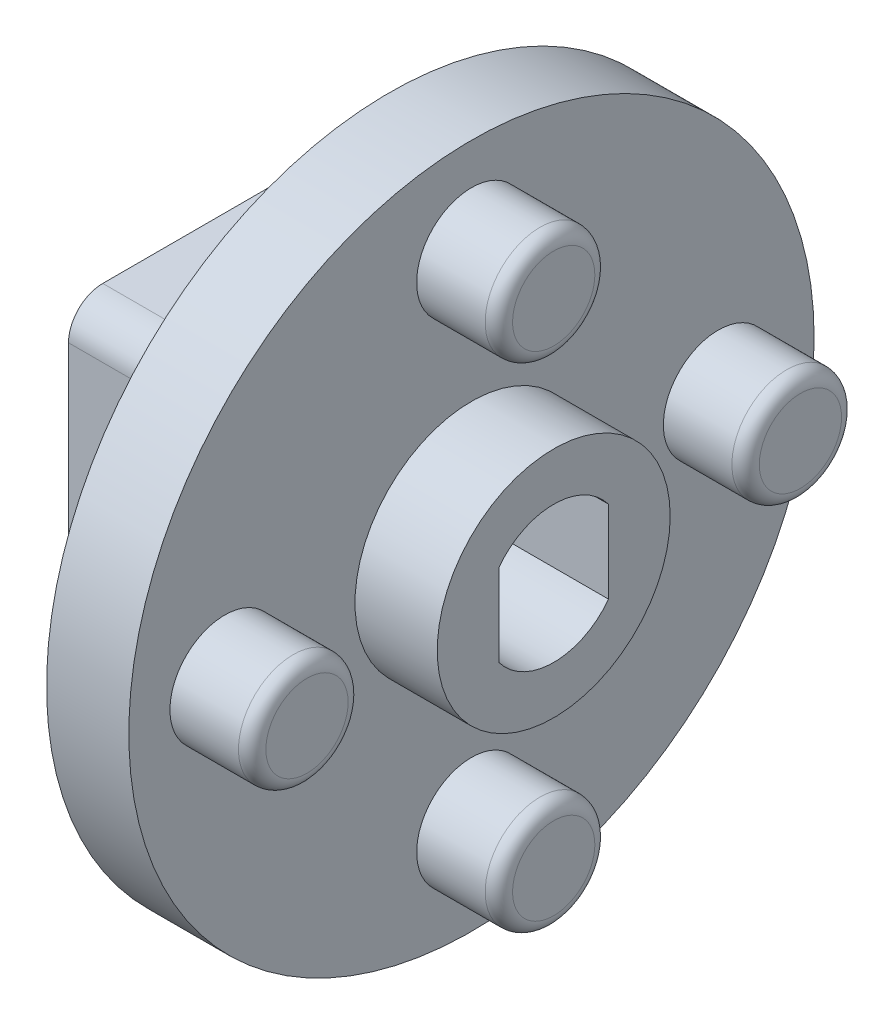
ISO-10303-21;
HEADER;
FILE_DESCRIPTION(('STEP AP214'),'2;1');
FILE_NAME('part.step','',(''),(''),'','','');
FILE_SCHEMA(('AUTOMOTIVE_DESIGN { 1 0 10303 214 1 1 1 1 }'));
ENDSEC;
DATA;
#1=APPLICATION_CONTEXT('core data for automotive mechanical design processes');
#2=APPLICATION_PROTOCOL_DEFINITION('international standard','automotive_design',2000,#1);
#3=PRODUCT_CONTEXT('',#1,'mechanical');
#4=PRODUCT('Part','Part','',(#3));
#5=PRODUCT_RELATED_PRODUCT_CATEGORY('part','',(#4));
#6=PRODUCT_DEFINITION_FORMATION('','',#4);
#7=PRODUCT_DEFINITION_CONTEXT('part definition',#1,'design');
#8=PRODUCT_DEFINITION('design','',#6,#7);
#9=PRODUCT_DEFINITION_SHAPE('','',#8);
#10=(LENGTH_UNIT() NAMED_UNIT(*) SI_UNIT(.MILLI.,.METRE.));
#11=(NAMED_UNIT(*) PLANE_ANGLE_UNIT() SI_UNIT($,.RADIAN.));
#12=(NAMED_UNIT(*) SI_UNIT($,.STERADIAN.) SOLID_ANGLE_UNIT());
#13=UNCERTAINTY_MEASURE_WITH_UNIT(LENGTH_MEASURE(1.E-05),#10,'distance_accuracy_value','');
#14=(GEOMETRIC_REPRESENTATION_CONTEXT(3) GLOBAL_UNCERTAINTY_ASSIGNED_CONTEXT((#13)) GLOBAL_UNIT_ASSIGNED_CONTEXT((#10,
#11,#12)) REPRESENTATION_CONTEXT('',''));
#15=CARTESIAN_POINT('',(0.,0.,0.));
#16=DIRECTION('',(0.,0.,1.));
#17=DIRECTION('',(1.,0.,0.));
#18=AXIS2_PLACEMENT_3D('',#15,#16,#17);
#19=CARTESIAN_POINT('',(0.,0.,0.));
#20=DIRECTION('',(1.,0.,0.));
#21=DIRECTION('',(0.,0.,-1.));
#22=AXIS2_PLACEMENT_3D('',#19,#20,#21);
#23=CYLINDRICAL_SURFACE('',#22,8.5);
#24=CARTESIAN_POINT('',(0.,0.,0.));
#25=DIRECTION('',(1.,0.,0.));
#26=DIRECTION('',(0.,0.,-1.));
#27=AXIS2_PLACEMENT_3D('',#24,#25,#26);
#28=CIRCLE('',#27,8.5);
#29=CARTESIAN_POINT('',(0.,0.,-8.5));
#30=VERTEX_POINT('',#29);
#31=EDGE_CURVE('E166',#30,#30,#28,.T.);
#32=ORIENTED_EDGE('',*,*,#31,.T.);
#33=EDGE_LOOP('',(#32));
#34=FACE_BOUND('',#33,.T.);
#35=CARTESIAN_POINT('',(2.,0.,0.));
#36=DIRECTION('',(1.,0.,0.));
#37=DIRECTION('',(0.,0.,-1.));
#38=AXIS2_PLACEMENT_3D('',#35,#36,#37);
#39=CIRCLE('',#38,8.5);
#40=CARTESIAN_POINT('',(2.,0.,-8.5));
#41=VERTEX_POINT('',#40);
#42=EDGE_CURVE('E188',#41,#41,#39,.F.);
#43=ORIENTED_EDGE('',*,*,#42,.T.);
#44=EDGE_LOOP('',(#43));
#45=FACE_BOUND('',#44,.T.);
#46=ADVANCED_FACE('F17',(#34,#45),#23,.T.);
#47=CARTESIAN_POINT('',(2.,0.,0.));
#48=DIRECTION('',(1.,0.,0.));
#49=DIRECTION('',(0.,0.,-1.));
#50=AXIS2_PLACEMENT_3D('',#47,#48,#49);
#51=PLANE('',#50);
#52=ORIENTED_EDGE('',*,*,#42,.F.);
#53=EDGE_LOOP('',(#52));
#54=FACE_BOUND('',#53,.T.);
#55=CARTESIAN_POINT('',(2.,9.9,-9.9));
#56=DIRECTION('',(-1.,0.,0.));
#57=DIRECTION('',(0.,0.,1.));
#58=AXIS2_PLACEMENT_3D('',#55,#56,#57);
#59=CIRCLE('',#58,2.5);
#60=CARTESIAN_POINT('',(2.,9.9,-12.4));
#61=VERTEX_POINT('',#60);
#62=CARTESIAN_POINT('',(2.,12.4,-9.9));
#63=VERTEX_POINT('',#62);
#64=EDGE_CURVE('E437',#61,#63,#59,.F.);
#65=ORIENTED_EDGE('',*,*,#64,.F.);
#66=DIRECTION('',(0.,1.,0.));
#67=VECTOR('',#66,1.);
#68=CARTESIAN_POINT('',(2.,-12.4,-12.4));
#69=LINE('',#68,#67);
#70=CARTESIAN_POINT('',(2.,-9.9,-12.4));
#71=VERTEX_POINT('',#70);
#72=EDGE_CURVE('E439',#71,#61,#69,.T.);
#73=ORIENTED_EDGE('',*,*,#72,.F.);
#74=CARTESIAN_POINT('',(2.,-9.9,-9.9));
#75=DIRECTION('',(-1.,0.,0.));
#76=DIRECTION('',(0.,0.,1.));
#77=AXIS2_PLACEMENT_3D('',#74,#75,#76);
#78=CIRCLE('',#77,2.5);
#79=CARTESIAN_POINT('',(2.,-12.4,-9.9));
#80=VERTEX_POINT('',#79);
#81=EDGE_CURVE('E162',#80,#71,#78,.F.);
#82=ORIENTED_EDGE('',*,*,#81,.F.);
#83=DIRECTION('',(0.,0.,-1.));
#84=VECTOR('',#83,1.);
#85=CARTESIAN_POINT('',(2.,-12.4,12.4));
#86=LINE('',#85,#84);
#87=CARTESIAN_POINT('',(2.,-12.4,9.9));
#88=VERTEX_POINT('',#87);
#89=EDGE_CURVE('E158',#88,#80,#86,.T.);
#90=ORIENTED_EDGE('',*,*,#89,.F.);
#91=CARTESIAN_POINT('',(2.,-9.9,9.9));
#92=DIRECTION('',(-1.,0.,0.));
#93=DIRECTION('',(0.,0.,1.));
#94=AXIS2_PLACEMENT_3D('',#91,#92,#93);
#95=CIRCLE('',#94,2.5);
#96=CARTESIAN_POINT('',(2.,-9.9,12.4));
#97=VERTEX_POINT('',#96);
#98=EDGE_CURVE('E155',#97,#88,#95,.F.);
#99=ORIENTED_EDGE('',*,*,#98,.F.);
#100=DIRECTION('',(0.,1.,0.));
#101=VECTOR('',#100,1.);
#102=CARTESIAN_POINT('',(2.,12.4,12.4));
#103=LINE('',#102,#101);
#104=CARTESIAN_POINT('',(2.,9.9,12.4));
#105=VERTEX_POINT('',#104);
#106=EDGE_CURVE('E179',#105,#97,#103,.F.);
#107=ORIENTED_EDGE('',*,*,#106,.F.);
#108=CARTESIAN_POINT('',(2.,9.9,9.9));
#109=DIRECTION('',(-1.,0.,0.));
#110=DIRECTION('',(0.,0.,1.));
#111=AXIS2_PLACEMENT_3D('',#108,#109,#110);
#112=CIRCLE('',#111,2.5);
#113=CARTESIAN_POINT('',(2.,12.4,9.9));
#114=VERTEX_POINT('',#113);
#115=EDGE_CURVE('E184',#114,#105,#112,.F.);
#116=ORIENTED_EDGE('',*,*,#115,.F.);
#117=DIRECTION('',(0.,0.,1.));
#118=VECTOR('',#117,1.);
#119=CARTESIAN_POINT('',(2.,12.4,-12.4));
#120=LINE('',#119,#118);
#121=EDGE_CURVE('E452',#63,#114,#120,.T.);
#122=ORIENTED_EDGE('',*,*,#121,.F.);
#123=EDGE_LOOP('',(#65,#73,#82,#90,#99,#107,#116,#122));
#124=FACE_BOUND('',#123,.T.);
#125=ADVANCED_FACE('F160',(#54,#124),#51,.F.);
#126=CARTESIAN_POINT('',(0.,0.,0.));
#127=DIRECTION('',(1.,0.,0.));
#128=DIRECTION('',(0.,0.,-1.));
#129=AXIS2_PLACEMENT_3D('',#126,#127,#128);
#130=PLANE('',#129);
#131=CARTESIAN_POINT('',(0.,0.,0.));
#132=DIRECTION('',(1.,0.,0.));
#133=DIRECTION('',(0.,0.,-1.));
#134=AXIS2_PLACEMENT_3D('',#131,#132,#133);
#135=CIRCLE('',#134,5.);
#136=CARTESIAN_POINT('',(0.,-3.,4.));
#137=VERTEX_POINT('',#136);
#138=CARTESIAN_POINT('',(0.,-3.,-4.));
#139=VERTEX_POINT('',#138);
#140=EDGE_CURVE('E432',#137,#139,#135,.T.);
#141=ORIENTED_EDGE('',*,*,#140,.T.);
#142=DIRECTION('',(0.,1.,0.));
#143=VECTOR('',#142,1.);
#144=CARTESIAN_POINT('',(0.,-3.,-4.));
#145=LINE('',#144,#143);
#146=CARTESIAN_POINT('',(0.,3.,-4.));
#147=VERTEX_POINT('',#146);
#148=EDGE_CURVE('E435',#139,#147,#145,.T.);
#149=ORIENTED_EDGE('',*,*,#148,.T.);
#150=CARTESIAN_POINT('',(0.,0.,0.));
#151=DIRECTION('',(1.,0.,0.));
#152=DIRECTION('',(0.,0.,-1.));
#153=AXIS2_PLACEMENT_3D('',#150,#151,#152);
#154=CIRCLE('',#153,5.);
#155=CARTESIAN_POINT('',(0.,3.,4.));
#156=VERTEX_POINT('',#155);
#157=EDGE_CURVE('E428',#147,#156,#154,.T.);
#158=ORIENTED_EDGE('',*,*,#157,.T.);
#159=DIRECTION('',(0.,1.,0.));
#160=VECTOR('',#159,1.);
#161=CARTESIAN_POINT('',(0.,3.,4.));
#162=LINE('',#161,#160);
#163=EDGE_CURVE('E462',#156,#137,#162,.F.);
#164=ORIENTED_EDGE('',*,*,#163,.T.);
#165=EDGE_LOOP('',(#141,#149,#158,#164));
#166=FACE_BOUND('',#165,.T.);
#167=ORIENTED_EDGE('',*,*,#31,.F.);
#168=EDGE_LOOP('',(#167));
#169=FACE_BOUND('',#168,.T.);
#170=ADVANCED_FACE('F602',(#166,#169),#130,.F.);
#171=CARTESIAN_POINT('',(2.,-12.4,12.4));
#172=DIRECTION('',(0.,-1.,0.));
#173=DIRECTION('',(0.,0.,-1.));
#174=AXIS2_PLACEMENT_3D('',#171,#172,#173);
#175=PLANE('',#174);
#176=DIRECTION('',(0.,0.,-1.));
#177=VECTOR('',#176,1.);
#178=CARTESIAN_POINT('',(13.,-12.4,0.));
#179=LINE('',#178,#177);
#180=CARTESIAN_POINT('',(13.,-12.4,-9.9));
#181=VERTEX_POINT('',#180);
#182=CARTESIAN_POINT('',(13.,-12.4,9.9));
#183=VERTEX_POINT('',#182);
#184=EDGE_CURVE('E171',#181,#183,#179,.F.);
#185=ORIENTED_EDGE('',*,*,#184,.T.);
#186=DIRECTION('',(-1.,0.,0.));
#187=VECTOR('',#186,1.);
#188=CARTESIAN_POINT('',(57.59,-12.4,9.9));
#189=LINE('',#188,#187);
#190=EDGE_CURVE('E165',#88,#183,#189,.F.);
#191=ORIENTED_EDGE('',*,*,#190,.F.);
#192=ORIENTED_EDGE('',*,*,#89,.T.);
#193=DIRECTION('',(-1.,0.,0.));
#194=VECTOR('',#193,1.);
#195=CARTESIAN_POINT('',(57.59,-12.4,-9.9));
#196=LINE('',#195,#194);
#197=EDGE_CURVE('E436',#181,#80,#196,.T.);
#198=ORIENTED_EDGE('',*,*,#197,.F.);
#199=EDGE_LOOP('',(#185,#191,#192,#198));
#200=FACE_BOUND('',#199,.T.);
#201=ADVANCED_FACE('F169',(#200),#175,.T.);
#202=CARTESIAN_POINT('',(57.59,-9.9,9.9));
#203=DIRECTION('',(-1.,0.,0.));
#204=DIRECTION('',(0.,0.,1.));
#205=AXIS2_PLACEMENT_3D('',#202,#203,#204);
#206=CYLINDRICAL_SURFACE('',#205,2.5);
#207=DIRECTION('',(1.,0.,0.));
#208=VECTOR('',#207,1.);
#209=CARTESIAN_POINT('',(2.,-9.9,12.4));
#210=LINE('',#209,#208);
#211=CARTESIAN_POINT('',(13.,-9.9,12.4));
#212=VERTEX_POINT('',#211);
#213=EDGE_CURVE('E177',#97,#212,#210,.T.);
#214=ORIENTED_EDGE('',*,*,#213,.F.);
#215=ORIENTED_EDGE('',*,*,#98,.T.);
#216=ORIENTED_EDGE('',*,*,#190,.T.);
#217=CARTESIAN_POINT('',(13.,-9.9,9.9));
#218=DIRECTION('',(-1.,0.,0.));
#219=DIRECTION('',(0.,0.,1.));
#220=AXIS2_PLACEMENT_3D('',#217,#218,#219);
#221=CIRCLE('',#220,2.5);
#222=EDGE_CURVE('E298',#183,#212,#221,.T.);
#223=ORIENTED_EDGE('',*,*,#222,.T.);
#224=EDGE_LOOP('',(#214,#215,#216,#223));
#225=FACE_BOUND('',#224,.T.);
#226=ADVANCED_FACE('F175',(#225),#206,.T.);
#227=CARTESIAN_POINT('',(2.,12.4,12.4));
#228=DIRECTION('',(0.,0.,1.));
#229=DIRECTION('',(1.,0.,0.));
#230=AXIS2_PLACEMENT_3D('',#227,#228,#229);
#231=PLANE('',#230);
#232=DIRECTION('',(0.,1.,0.));
#233=VECTOR('',#232,1.);
#234=CARTESIAN_POINT('',(13.,0.,12.4));
#235=LINE('',#234,#233);
#236=CARTESIAN_POINT('',(13.,9.9,12.4));
#237=VERTEX_POINT('',#236);
#238=EDGE_CURVE('E300',#212,#237,#235,.T.);
#239=ORIENTED_EDGE('',*,*,#238,.T.);
#240=DIRECTION('',(-1.,0.,0.));
#241=VECTOR('',#240,1.);
#242=CARTESIAN_POINT('',(57.59,9.9,12.4));
#243=LINE('',#242,#241);
#244=EDGE_CURVE('E457',#105,#237,#243,.F.);
#245=ORIENTED_EDGE('',*,*,#244,.F.);
#246=ORIENTED_EDGE('',*,*,#106,.T.);
#247=ORIENTED_EDGE('',*,*,#213,.T.);
#248=EDGE_LOOP('',(#239,#245,#246,#247));
#249=FACE_BOUND('',#248,.T.);
#250=ADVANCED_FACE('F755',(#249),#231,.T.);
#251=CARTESIAN_POINT('',(57.59,9.9,9.9));
#252=DIRECTION('',(-1.,0.,0.));
#253=DIRECTION('',(0.,0.,1.));
#254=AXIS2_PLACEMENT_3D('',#251,#252,#253);
#255=CYLINDRICAL_SURFACE('',#254,2.5);
#256=DIRECTION('',(1.,0.,0.));
#257=VECTOR('',#256,1.);
#258=CARTESIAN_POINT('',(2.,12.4,9.9));
#259=LINE('',#258,#257);
#260=CARTESIAN_POINT('',(13.,12.4,9.9));
#261=VERTEX_POINT('',#260);
#262=EDGE_CURVE('E447',#114,#261,#259,.T.);
#263=ORIENTED_EDGE('',*,*,#262,.F.);
#264=ORIENTED_EDGE('',*,*,#115,.T.);
#265=ORIENTED_EDGE('',*,*,#244,.T.);
#266=CARTESIAN_POINT('',(13.,9.9,9.9));
#267=DIRECTION('',(-1.,0.,0.));
#268=DIRECTION('',(0.,0.,1.));
#269=AXIS2_PLACEMENT_3D('',#266,#267,#268);
#270=CIRCLE('',#269,2.5);
#271=EDGE_CURVE('E302',#237,#261,#270,.T.);
#272=ORIENTED_EDGE('',*,*,#271,.T.);
#273=EDGE_LOOP('',(#263,#264,#265,#272));
#274=FACE_BOUND('',#273,.T.);
#275=ADVANCED_FACE('F747',(#274),#255,.T.);
#276=CARTESIAN_POINT('',(2.,12.4,-12.4));
#277=DIRECTION('',(0.,1.,0.));
#278=DIRECTION('',(0.,0.,1.));
#279=AXIS2_PLACEMENT_3D('',#276,#277,#278);
#280=PLANE('',#279);
#281=ORIENTED_EDGE('',*,*,#121,.T.);
#282=ORIENTED_EDGE('',*,*,#262,.T.);
#283=DIRECTION('',(0.,0.,-1.));
#284=VECTOR('',#283,1.);
#285=CARTESIAN_POINT('',(13.,12.4,0.));
#286=LINE('',#285,#284);
#287=CARTESIAN_POINT('',(13.,12.4,-9.9));
#288=VERTEX_POINT('',#287);
#289=EDGE_CURVE('E303',#261,#288,#286,.T.);
#290=ORIENTED_EDGE('',*,*,#289,.T.);
#291=DIRECTION('',(-1.,0.,0.));
#292=VECTOR('',#291,1.);
#293=CARTESIAN_POINT('',(57.59,12.4,-9.9));
#294=LINE('',#293,#292);
#295=EDGE_CURVE('E440',#63,#288,#294,.F.);
#296=ORIENTED_EDGE('',*,*,#295,.F.);
#297=EDGE_LOOP('',(#281,#282,#290,#296));
#298=FACE_BOUND('',#297,.T.);
#299=ADVANCED_FACE('F740',(#298),#280,.T.);
#300=CARTESIAN_POINT('',(57.59,9.9,-9.9));
#301=DIRECTION('',(-1.,0.,0.));
#302=DIRECTION('',(0.,0.,1.));
#303=AXIS2_PLACEMENT_3D('',#300,#301,#302);
#304=CYLINDRICAL_SURFACE('',#303,2.5);
#305=DIRECTION('',(-1.,0.,0.));
#306=VECTOR('',#305,1.);
#307=CARTESIAN_POINT('',(2.,9.9,-12.4));
#308=LINE('',#307,#306);
#309=CARTESIAN_POINT('',(13.,9.9,-12.4));
#310=VERTEX_POINT('',#309);
#311=EDGE_CURVE('E445',#61,#310,#308,.F.);
#312=ORIENTED_EDGE('',*,*,#311,.F.);
#313=ORIENTED_EDGE('',*,*,#64,.T.);
#314=ORIENTED_EDGE('',*,*,#295,.T.);
#315=CARTESIAN_POINT('',(13.,9.9,-9.9));
#316=DIRECTION('',(-1.,0.,0.));
#317=DIRECTION('',(0.,0.,1.));
#318=AXIS2_PLACEMENT_3D('',#315,#316,#317);
#319=CIRCLE('',#318,2.5);
#320=EDGE_CURVE('E305',#288,#310,#319,.T.);
#321=ORIENTED_EDGE('',*,*,#320,.T.);
#322=EDGE_LOOP('',(#312,#313,#314,#321));
#323=FACE_BOUND('',#322,.T.);
#324=ADVANCED_FACE('F734',(#323),#304,.T.);
#325=CARTESIAN_POINT('',(2.,-12.4,-12.4));
#326=DIRECTION('',(0.,0.,-1.));
#327=DIRECTION('',(-1.,0.,0.));
#328=AXIS2_PLACEMENT_3D('',#325,#326,#327);
#329=PLANE('',#328);
#330=DIRECTION('',(0.,1.,0.));
#331=VECTOR('',#330,1.);
#332=CARTESIAN_POINT('',(13.,0.,-12.4));
#333=LINE('',#332,#331);
#334=CARTESIAN_POINT('',(13.,-9.9,-12.4));
#335=VERTEX_POINT('',#334);
#336=EDGE_CURVE('E306',#310,#335,#333,.F.);
#337=ORIENTED_EDGE('',*,*,#336,.T.);
#338=DIRECTION('',(-1.,0.,0.));
#339=VECTOR('',#338,1.);
#340=CARTESIAN_POINT('',(57.59,-9.9,-12.4));
#341=LINE('',#340,#339);
#342=EDGE_CURVE('E567',#71,#335,#341,.F.);
#343=ORIENTED_EDGE('',*,*,#342,.F.);
#344=ORIENTED_EDGE('',*,*,#72,.T.);
#345=ORIENTED_EDGE('',*,*,#311,.T.);
#346=EDGE_LOOP('',(#337,#343,#344,#345));
#347=FACE_BOUND('',#346,.T.);
#348=ADVANCED_FACE('F566',(#347),#329,.T.);
#349=CARTESIAN_POINT('',(57.59,-9.9,-9.9));
#350=DIRECTION('',(-1.,0.,0.));
#351=DIRECTION('',(0.,0.,1.));
#352=AXIS2_PLACEMENT_3D('',#349,#350,#351);
#353=CYLINDRICAL_SURFACE('',#352,2.5);
#354=ORIENTED_EDGE('',*,*,#197,.T.);
#355=ORIENTED_EDGE('',*,*,#81,.T.);
#356=ORIENTED_EDGE('',*,*,#342,.T.);
#357=CARTESIAN_POINT('',(13.,-9.9,-9.9));
#358=DIRECTION('',(-1.,0.,0.));
#359=DIRECTION('',(0.,0.,1.));
#360=AXIS2_PLACEMENT_3D('',#357,#358,#359);
#361=CIRCLE('',#360,2.5);
#362=EDGE_CURVE('E292',#335,#181,#361,.T.);
#363=ORIENTED_EDGE('',*,*,#362,.T.);
#364=EDGE_LOOP('',(#354,#355,#356,#363));
#365=FACE_BOUND('',#364,.T.);
#366=ADVANCED_FACE('F569',(#365),#353,.T.);
#367=CARTESIAN_POINT('',(0.,-3.,-4.));
#368=DIRECTION('',(0.,0.,-1.));
#369=DIRECTION('',(-1.,0.,0.));
#370=AXIS2_PLACEMENT_3D('',#367,#368,#369);
#371=PLANE('',#370);
#372=DIRECTION('',(0.,1.,0.));
#373=VECTOR('',#372,1.);
#374=CARTESIAN_POINT('',(25.,0.,-4.));
#375=LINE('',#374,#373);
#376=CARTESIAN_POINT('',(25.,3.,-4.));
#377=VERTEX_POINT('',#376);
#378=CARTESIAN_POINT('',(25.,-3.,-4.));
#379=VERTEX_POINT('',#378);
#380=EDGE_CURVE('E288',#377,#379,#375,.F.);
#381=ORIENTED_EDGE('',*,*,#380,.F.);
#382=DIRECTION('',(1.,0.,0.));
#383=VECTOR('',#382,1.);
#384=CARTESIAN_POINT('',(0.,3.,-4.));
#385=LINE('',#384,#383);
#386=EDGE_CURVE('E299',#377,#147,#385,.F.);
#387=ORIENTED_EDGE('',*,*,#386,.T.);
#388=ORIENTED_EDGE('',*,*,#148,.F.);
#389=DIRECTION('',(1.,0.,0.));
#390=VECTOR('',#389,1.);
#391=CARTESIAN_POINT('',(0.,-3.,-4.));
#392=LINE('',#391,#390);
#393=EDGE_CURVE('E434',#139,#379,#392,.T.);
#394=ORIENTED_EDGE('',*,*,#393,.T.);
#395=EDGE_LOOP('',(#381,#387,#388,#394));
#396=FACE_BOUND('',#395,.T.);
#397=ADVANCED_FACE('F605',(#396),#371,.F.);
#398=CARTESIAN_POINT('',(0.,0.,0.));
#399=DIRECTION('',(1.,0.,0.));
#400=DIRECTION('',(0.,0.,-1.));
#401=AXIS2_PLACEMENT_3D('',#398,#399,#400);
#402=CYLINDRICAL_SURFACE('',#401,5.);
#403=CARTESIAN_POINT('',(25.,0.,0.));
#404=DIRECTION('',(1.,0.,0.));
#405=DIRECTION('',(0.,0.,-1.));
#406=AXIS2_PLACEMENT_3D('',#403,#404,#405);
#407=CIRCLE('',#406,5.);
#408=CARTESIAN_POINT('',(25.,-3.,4.));
#409=VERTEX_POINT('',#408);
#410=EDGE_CURVE('E291',#379,#409,#407,.F.);
#411=ORIENTED_EDGE('',*,*,#410,.F.);
#412=ORIENTED_EDGE('',*,*,#393,.F.);
#413=ORIENTED_EDGE('',*,*,#140,.F.);
#414=DIRECTION('',(1.,0.,0.));
#415=VECTOR('',#414,1.);
#416=CARTESIAN_POINT('',(0.,-3.,4.));
#417=LINE('',#416,#415);
#418=EDGE_CURVE('E431',#137,#409,#417,.T.);
#419=ORIENTED_EDGE('',*,*,#418,.T.);
#420=EDGE_LOOP('',(#411,#412,#413,#419));
#421=FACE_BOUND('',#420,.T.);
#422=ADVANCED_FACE('F598',(#421),#402,.F.);
#423=CARTESIAN_POINT('',(0.,3.,4.));
#424=DIRECTION('',(0.,0.,1.));
#425=DIRECTION('',(1.,0.,0.));
#426=AXIS2_PLACEMENT_3D('',#423,#424,#425);
#427=PLANE('',#426);
#428=DIRECTION('',(0.,1.,0.));
#429=VECTOR('',#428,1.);
#430=CARTESIAN_POINT('',(25.,0.,4.));
#431=LINE('',#430,#429);
#432=CARTESIAN_POINT('',(25.,3.,4.));
#433=VERTEX_POINT('',#432);
#434=EDGE_CURVE('E293',#409,#433,#431,.T.);
#435=ORIENTED_EDGE('',*,*,#434,.F.);
#436=ORIENTED_EDGE('',*,*,#418,.F.);
#437=ORIENTED_EDGE('',*,*,#163,.F.);
#438=DIRECTION('',(1.,0.,0.));
#439=VECTOR('',#438,1.);
#440=CARTESIAN_POINT('',(0.,3.,4.));
#441=LINE('',#440,#439);
#442=EDGE_CURVE('E430',#156,#433,#441,.T.);
#443=ORIENTED_EDGE('',*,*,#442,.T.);
#444=EDGE_LOOP('',(#435,#436,#437,#443));
#445=FACE_BOUND('',#444,.T.);
#446=ADVANCED_FACE('F588',(#445),#427,.F.);
#447=CARTESIAN_POINT('',(0.,0.,0.));
#448=DIRECTION('',(1.,0.,0.));
#449=DIRECTION('',(0.,0.,-1.));
#450=AXIS2_PLACEMENT_3D('',#447,#448,#449);
#451=CYLINDRICAL_SURFACE('',#450,5.);
#452=CARTESIAN_POINT('',(25.,0.,0.));
#453=DIRECTION('',(1.,0.,0.));
#454=DIRECTION('',(0.,0.,-1.));
#455=AXIS2_PLACEMENT_3D('',#452,#453,#454);
#456=CIRCLE('',#455,5.);
#457=EDGE_CURVE('E296',#433,#377,#456,.F.);
#458=ORIENTED_EDGE('',*,*,#457,.F.);
#459=ORIENTED_EDGE('',*,*,#442,.F.);
#460=ORIENTED_EDGE('',*,*,#157,.F.);
#461=ORIENTED_EDGE('',*,*,#386,.F.);
#462=EDGE_LOOP('',(#458,#459,#460,#461));
#463=FACE_BOUND('',#462,.T.);
#464=ADVANCED_FACE('F593',(#463),#451,.F.);
#465=CARTESIAN_POINT('',(25.,0.,0.));
#466=DIRECTION('',(1.,0.,0.));
#467=DIRECTION('',(0.,0.,-1.));
#468=AXIS2_PLACEMENT_3D('',#465,#466,#467);
#469=PLANE('',#468);
#470=CARTESIAN_POINT('',(25.,18.,0.));
#471=DIRECTION('',(-1.,0.,0.));
#472=DIRECTION('',(0.,0.0288327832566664,0.99958424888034));
#473=AXIS2_PLACEMENT_3D('',#470,#471,#472);
#474=CIRCLE('',#473,2.99999999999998);
#475=CARTESIAN_POINT('',(25.,18.08649834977,2.99875274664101));
#476=VERTEX_POINT('',#475);
#477=CARTESIAN_POINT('',(25.,18.,-2.99999999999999));
#478=VERTEX_POINT('',#477);
#479=EDGE_CURVE('E397',#476,#478,#474,.T.);
#480=ORIENTED_EDGE('',*,*,#479,.F.);
#481=DIRECTION('',(0.,-0.999896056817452,0.0144178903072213));
#482=VECTOR('',#481,1.);
#483=CARTESIAN_POINT('',(25.,18.08649834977,2.99875274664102));
#484=LINE('',#483,#482);
#485=CARTESIAN_POINT('',(25.,18.000000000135,3.));
#486=VERTEX_POINT('',#485);
#487=EDGE_CURVE('E410',#486,#476,#484,.F.);
#488=ORIENTED_EDGE('',*,*,#487,.F.);
#489=CARTESIAN_POINT('',(25.,17.9135016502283,-2.99875274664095));
#490=CARTESIAN_POINT('',(24.999999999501,17.8823313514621,-2.99784881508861));
#491=CARTESIAN_POINT('',(24.9999999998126,17.8511753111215,-2.99646374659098));
#492=CARTESIAN_POINT('',(25.0000000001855,17.7889205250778,-2.99273502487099));
#493=CARTESIAN_POINT('',(25.0000000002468,17.7578217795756,-2.99039136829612));
#494=CARTESIAN_POINT('',(24.9999999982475,17.6957100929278,-2.98474912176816));
#495=CARTESIAN_POINT('',(24.9999999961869,17.6646971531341,-2.98145051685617));
#496=CARTESIAN_POINT('',(24.9999999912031,17.602789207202,-2.9738932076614));
#497=CARTESIAN_POINT('',(24.9999999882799,17.5718942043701,-2.96963447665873));
#498=CARTESIAN_POINT('',(24.9999999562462,17.4952673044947,-2.95789940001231));
#499=CARTESIAN_POINT('',(24.9999999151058,17.4496177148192,-2.94986493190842));
#500=CARTESIAN_POINT('',(24.9999998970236,17.4009983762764,-2.94005634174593));
#501=CARTESIAN_POINT('',(24.9999998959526,17.3977953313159,-2.93940430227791));
#502=CARTESIAN_POINT('',(24.999999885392,17.3576538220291,-2.93115802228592));
#503=CARTESIAN_POINT('',(24.9999999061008,17.3208671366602,-2.92280728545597));
#504=CARTESIAN_POINT('',(24.9999999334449,17.2514608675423,-2.90569002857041));
#505=CARTESIAN_POINT('',(24.9999999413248,17.2188075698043,-2.89705816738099));
#506=CARTESIAN_POINT('',(24.9999999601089,17.1442436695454,-2.8759852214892));
#507=CARTESIAN_POINT('',(24.9999999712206,17.102437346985,-2.86317077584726));
#508=CARTESIAN_POINT('',(24.9999999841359,17.037368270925,-2.84166093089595));
#509=CARTESIAN_POINT('',(24.9999999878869,17.0139002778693,-2.83357897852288));
#510=CARTESIAN_POINT('',(24.9999999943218,16.9649647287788,-2.81604222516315));
#511=CARTESIAN_POINT('',(24.9999999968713,16.9395177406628,-2.80652986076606));
#512=CARTESIAN_POINT('',(25.0000000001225,16.8821988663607,-2.78421719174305));
#513=CARTESIAN_POINT('',(25.0000000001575,16.850406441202,-2.77121235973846));
#514=CARTESIAN_POINT('',(24.999999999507,16.7881582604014,-2.74450926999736));
#515=CARTESIAN_POINT('',(24.9999999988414,16.7576899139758,-2.73084033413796));
#516=CARTESIAN_POINT('',(24.9999999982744,16.6972211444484,-2.7025042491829));
#517=CARTESIAN_POINT('',(24.999999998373,16.6672207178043,-2.68783710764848));
#518=CARTESIAN_POINT('',(24.9999999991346,16.6077199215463,-2.65752100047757));
#519=CARTESIAN_POINT('',(24.9999999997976,16.5782195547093,-2.64187202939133));
#520=CARTESIAN_POINT('',(25.0000000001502,16.5197508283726,-2.6096087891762));
#521=CARTESIAN_POINT('',(24.9999999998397,16.4907824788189,-2.59299450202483));
#522=CARTESIAN_POINT('',(24.9999999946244,16.4334082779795,-2.55881908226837));
#523=CARTESIAN_POINT('',(24.9999999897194,16.4050024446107,-2.54125791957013));
#524=CARTESIAN_POINT('',(24.9999999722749,16.3487864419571,-2.50520543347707));
#525=CARTESIAN_POINT('',(24.9999999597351,16.3209762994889,-2.48671406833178));
#526=CARTESIAN_POINT('',(24.9999999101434,16.2604719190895,-2.44504065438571));
#527=CARTESIAN_POINT('',(24.9999998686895,16.2279136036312,-2.42166026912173));
#528=CARTESIAN_POINT('',(24.9999997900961,16.1742792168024,-2.38146239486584));
#529=CARTESIAN_POINT('',(24.9999997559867,16.1529334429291,-2.36500204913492));
#530=CARTESIAN_POINT('',(24.9999996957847,16.0790492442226,-2.3063522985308));
#531=CARTESIAN_POINT('',(24.9999997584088,16.0277335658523,-2.2625933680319));
#532=CARTESIAN_POINT('',(24.9999999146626,15.9454875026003,-2.18707515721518));
#533=CARTESIAN_POINT('',(24.9999999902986,15.9136004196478,-2.15634602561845));
#534=CARTESIAN_POINT('',(25.0000000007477,15.8768661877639,-2.11954774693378));
#535=CARTESIAN_POINT('',(25.0000000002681,15.8714273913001,-2.11406252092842));
#536=CARTESIAN_POINT('',(24.9999999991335,15.8502884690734,-2.0926107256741));
#537=CARTESIAN_POINT('',(24.9999999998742,15.8347140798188,-2.07651952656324));
#538=CARTESIAN_POINT('',(25.0000000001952,15.7948538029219,-2.03440258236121));
#539=CARTESIAN_POINT('',(24.9999999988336,15.7708454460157,-2.00811293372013));
#540=CARTESIAN_POINT('',(24.9999999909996,15.7251478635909,-1.95627212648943));
#541=CARTESIAN_POINT('',(24.9999999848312,15.7034051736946,-1.930767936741));
#542=CARTESIAN_POINT('',(24.9999999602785,15.6564917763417,-1.87384920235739));
#543=CARTESIAN_POINT('',(24.9999999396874,15.6315107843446,-1.842277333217));
#544=CARTESIAN_POINT('',(24.9999999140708,15.6019956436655,-1.80336834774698));
#545=CARTESIAN_POINT('',(24.9999999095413,15.5968339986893,-1.79650194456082));
#546=CARTESIAN_POINT('',(24.9999998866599,15.5658979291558,-1.75496022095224));
#547=CARTESIAN_POINT('',(24.999999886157,15.5408740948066,-1.71971884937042));
#548=CARTESIAN_POINT('',(24.9999998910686,15.5002061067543,-1.65972476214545));
#549=CARTESIAN_POINT('',(24.9999998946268,15.4841399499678,-1.63525533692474));
#550=CARTESIAN_POINT('',(24.9999999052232,15.4499944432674,-1.58153962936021));
#551=CARTESIAN_POINT('',(24.9999999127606,15.4320532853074,-1.55220517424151));
#552=CARTESIAN_POINT('',(24.9999999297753,15.3946038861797,-1.48853065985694));
#553=CARTESIAN_POINT('',(24.9999999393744,15.3752589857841,-1.45409456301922));
#554=CARTESIAN_POINT('',(24.9999999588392,15.3355339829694,-1.3799789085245));
#555=CARTESIAN_POINT('',(24.9999999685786,15.3153436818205,-1.34019730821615));
#556=CARTESIAN_POINT('',(24.9999999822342,15.2827065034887,-1.27216770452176));
#557=CARTESIAN_POINT('',(24.9999999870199,15.2697907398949,-1.2441432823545));
#558=CARTESIAN_POINT('',(24.999999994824,15.2440054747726,-1.18583736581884));
#559=CARTESIAN_POINT('',(24.9999999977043,15.2311957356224,-1.15552934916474));
#560=CARTESIAN_POINT('',(24.9999999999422,15.2102519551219,-1.10362120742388));
#561=CARTESIAN_POINT('',(25.0000000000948,15.2018638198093,-1.08212300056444));
#562=CARTESIAN_POINT('',(24.9999999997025,15.1826386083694,-1.03114480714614));
#563=CARTESIAN_POINT('',(24.9999999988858,15.1720108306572,-1.00158551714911));
#564=CARTESIAN_POINT('',(24.9999999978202,15.1516781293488,-0.942152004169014));
#565=CARTESIAN_POINT('',(24.9999999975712,15.1419731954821,-0.912277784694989));
#566=CARTESIAN_POINT('',(24.9999999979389,15.1234945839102,-0.852242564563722));
#567=CARTESIAN_POINT('',(24.9999999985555,15.1147209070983,-0.822081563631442));
#568=CARTESIAN_POINT('',(24.999999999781,15.0981134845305,-0.761501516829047));
#569=CARTESIAN_POINT('',(25.0000000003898,15.0902797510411,-0.731082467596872));
#570=CARTESIAN_POINT('',(24.9999999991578,15.0755591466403,-0.670015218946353));
#571=CARTESIAN_POINT('',(24.999999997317,15.0686722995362,-0.639367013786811));
#572=CARTESIAN_POINT('',(24.9999999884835,15.0558538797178,-0.577870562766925));
#573=CARTESIAN_POINT('',(24.9999999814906,15.0499223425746,-0.547022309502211));
#574=CARTESIAN_POINT('',(24.9999999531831,15.0384569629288,-0.48199875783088));
#575=CARTESIAN_POINT('',(24.9999999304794,15.033025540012,-0.447805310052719));
#576=CARTESIAN_POINT('',(24.9999998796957,15.0242759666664,-0.385762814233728));
#577=CARTESIAN_POINT('',(24.9999998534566,15.0207523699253,-0.357942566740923));
#578=CARTESIAN_POINT('',(24.9999998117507,15.0141602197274,-0.299043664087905));
#579=CARTESIAN_POINT('',(24.9999997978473,15.0111889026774,-0.267954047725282));
#580=CARTESIAN_POINT('',(24.9999997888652,15.0062458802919,-0.205695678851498));
#581=CARTESIAN_POINT('',(24.9999997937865,15.004274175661,-0.174526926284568));
#582=CARTESIAN_POINT('',(24.9999998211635,15.0013355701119,-0.112142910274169));
#583=CARTESIAN_POINT('',(24.9999998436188,15.000368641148,-0.0809276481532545));
#584=CARTESIAN_POINT('',(24.9999998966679,14.9994355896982,-0.0184839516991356));
#585=CARTESIAN_POINT('',(24.9999999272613,14.9994694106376,0.0127444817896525));
#586=CARTESIAN_POINT('',(24.999999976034,15.0005434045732,0.0745444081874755));
#587=CARTESIAN_POINT('',(24.9999999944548,15.0015629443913,0.105116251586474));
#588=CARTESIAN_POINT('',(25.0000000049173,15.0045771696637,0.167451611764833));
#589=CARTESIAN_POINT('',(24.9999999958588,15.0066097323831,0.199213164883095));
#590=CARTESIAN_POINT('',(24.9999999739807,15.0136552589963,0.290598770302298));
#591=CARTESIAN_POINT('',(24.9999999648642,15.0197170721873,0.350150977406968));
#592=CARTESIAN_POINT('',(24.9999999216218,15.0344743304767,0.459397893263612));
#593=CARTESIAN_POINT('',(24.999999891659,15.0426049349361,0.509168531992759));
#594=CARTESIAN_POINT('',(24.9999998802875,15.0595693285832,0.598643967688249));
#595=CARTESIAN_POINT('',(24.9999998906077,15.0679628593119,0.638433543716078));
#596=CARTESIAN_POINT('',(24.9999999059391,15.0857539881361,0.715007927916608));
#597=CARTESIAN_POINT('',(24.9999999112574,15.0950478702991,0.751816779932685));
#598=CARTESIAN_POINT('',(24.9999999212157,15.1137745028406,0.820477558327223));
#599=CARTESIAN_POINT('',(24.9999999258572,15.1230446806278,0.852373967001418));
#600=CARTESIAN_POINT('',(24.9999999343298,15.1426385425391,0.915841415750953));
#601=CARTESIAN_POINT('',(24.9999999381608,15.1529622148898,0.947412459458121));
#602=CARTESIAN_POINT('',(24.9999999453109,15.174651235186,1.01019424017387));
#603=CARTESIAN_POINT('',(24.99999994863,15.1860165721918,1.04140498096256));
#604=CARTESIAN_POINT('',(24.9999999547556,15.2097765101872,1.10343186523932));
#605=CARTESIAN_POINT('',(24.999999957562,15.2221711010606,1.13424801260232));
#606=CARTESIAN_POINT('',(24.9999999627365,15.2479758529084,1.19545178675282));
#607=CARTESIAN_POINT('',(24.9999999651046,15.261386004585,1.22583941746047));
#608=CARTESIAN_POINT('',(24.9999999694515,15.289207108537,1.28615272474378));
#609=CARTESIAN_POINT('',(24.9999999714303,15.3036180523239,1.31607840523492));
#610=CARTESIAN_POINT('',(24.9999999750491,15.3334248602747,1.3754348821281));
#611=CARTESIAN_POINT('',(24.9999999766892,15.3488207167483,1.40486568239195));
#612=CARTESIAN_POINT('',(24.9999999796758,15.3805803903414,1.46320001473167));
#613=CARTESIAN_POINT('',(24.9999999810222,15.3969442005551,1.49210355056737));
#614=CARTESIAN_POINT('',(24.9999999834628,15.4306217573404,1.5493515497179));
#615=CARTESIAN_POINT('',(24.9999999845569,15.4479354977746,1.57769601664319));
#616=CARTESIAN_POINT('',(24.99999998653,15.4834938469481,1.63379468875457));
#617=CARTESIAN_POINT('',(24.999999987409,15.5017384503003,1.6615488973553));
#618=CARTESIAN_POINT('',(24.999999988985,15.5391384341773,1.71643651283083));
#619=CARTESIAN_POINT('',(24.999999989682,15.5582938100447,1.74356992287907));
#620=CARTESIAN_POINT('',(24.9999999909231,15.5974942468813,1.7971860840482));
#621=CARTESIAN_POINT('',(24.9999999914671,15.6175393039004,1.82366883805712));
#622=CARTESIAN_POINT('',(24.9999999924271,15.6584970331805,1.87595454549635));
#623=CARTESIAN_POINT('',(24.9999999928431,15.6794097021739,1.90175750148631));
#624=CARTESIAN_POINT('',(24.999999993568,15.7220796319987,1.95265521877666));
#625=CARTESIAN_POINT('',(24.9999999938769,15.7438368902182,1.97774998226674));
#626=CARTESIAN_POINT('',(24.9999999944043,15.7881720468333,2.02720369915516));
#627=CARTESIAN_POINT('',(24.9999999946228,15.8107499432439,2.05156265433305));
#628=CARTESIAN_POINT('',(24.9999999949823,15.8567015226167,2.09951794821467));
#629=CARTESIAN_POINT('',(24.9999999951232,15.8800752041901,2.12311428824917));
#630=CARTESIAN_POINT('',(24.999999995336,15.9275926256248,2.16951838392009));
#631=CARTESIAN_POINT('',(24.999999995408,15.951736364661,2.19232614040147));
#632=CARTESIAN_POINT('',(24.9999999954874,16.0007673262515,2.23712796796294));
#633=CARTESIAN_POINT('',(24.9999999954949,16.0256545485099,2.2591220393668));
#634=CARTESIAN_POINT('',(24.999999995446,16.0761450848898,2.30227229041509));
#635=CARTESIAN_POINT('',(24.9999999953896,16.1017483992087,2.32342846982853));
#636=CARTESIAN_POINT('',(24.9999999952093,16.1536429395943,2.36487965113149));
#637=CARTESIAN_POINT('',(24.9999999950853,16.1799341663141,2.38517465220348));
#638=CARTESIAN_POINT('',(24.9999999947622,16.2331756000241,2.42488113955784));
#639=CARTESIAN_POINT('',(24.9999999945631,16.2601258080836,2.44429262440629));
#640=CARTESIAN_POINT('',(24.9999999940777,16.3146555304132,2.48221070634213));
#641=CARTESIAN_POINT('',(24.9999999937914,16.3422350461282,2.50071730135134));
#642=CARTESIAN_POINT('',(24.9999999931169,16.3979930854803,2.53680525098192));
#643=CARTESIAN_POINT('',(24.9999999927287,16.4261716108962,2.55438660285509));
#644=CARTESIAN_POINT('',(24.9999999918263,16.4830964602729,2.58860463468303));
#645=CARTESIAN_POINT('',(24.9999999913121,16.5118427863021,2.6052413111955));
#646=CARTESIAN_POINT('',(24.9999999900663,16.5740168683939,2.63985961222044));
#647=CARTESIAN_POINT('',(24.999999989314,16.6075267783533,2.65769388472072));
#648=CARTESIAN_POINT('',(24.9999999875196,16.6751991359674,2.69207943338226));
#649=CARTESIAN_POINT('',(24.9999999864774,16.7093615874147,2.70863070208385));
#650=CARTESIAN_POINT('',(24.9999999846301,16.7683448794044,2.73583757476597));
#651=CARTESIAN_POINT('',(24.9999999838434,16.7930171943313,2.74681642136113));
#652=CARTESIAN_POINT('',(24.9999999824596,16.8426499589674,2.76810297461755));
#653=CARTESIAN_POINT('',(24.9999999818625,16.8676104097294,2.77841067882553));
#654=CARTESIAN_POINT('',(24.9999999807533,16.9219835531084,2.80000898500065));
#655=CARTESIAN_POINT('',(24.9999999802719,16.9514449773,2.81117710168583));
#656=CARTESIAN_POINT('',(24.9999999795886,17.010705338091,2.83257849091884));
#657=CARTESIAN_POINT('',(24.9999999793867,17.0405042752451,2.84281176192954));
#658=CARTESIAN_POINT('',(24.9999999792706,17.1004101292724,2.86233335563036));
#659=CARTESIAN_POINT('',(24.9999999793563,17.1305170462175,2.87162167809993));
#660=CARTESIAN_POINT('',(24.9999999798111,17.1910088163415,2.88924409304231));
#661=CARTESIAN_POINT('',(24.9999999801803,17.2213936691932,2.89757818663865));
#662=CARTESIAN_POINT('',(24.9999999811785,17.2824110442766,2.91328384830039));
#663=CARTESIAN_POINT('',(24.9999999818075,17.3130435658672,2.92065541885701));
#664=CARTESIAN_POINT('',(24.9999999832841,17.3745257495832,2.93442869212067));
#665=CARTESIAN_POINT('',(24.9999999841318,17.4053754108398,2.94083039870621));
#666=CARTESIAN_POINT('',(24.9999999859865,17.467261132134,2.95265757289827));
#667=CARTESIAN_POINT('',(24.9999999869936,17.4982971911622,2.95808304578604));
#668=CARTESIAN_POINT('',(24.9999999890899,17.5605247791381,2.96795235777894));
#669=CARTESIAN_POINT('',(24.9999999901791,17.5917163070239,2.97239620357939));
#670=CARTESIAN_POINT('',(24.9999999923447,17.6542237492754,2.98029784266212));
#671=CARTESIAN_POINT('',(24.999999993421,17.685539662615,2.98375564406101));
#672=CARTESIAN_POINT('',(24.9999999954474,17.7482646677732,2.98968177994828));
#673=CARTESIAN_POINT('',(24.9999999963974,17.7796737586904,2.99215012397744));
#674=CARTESIAN_POINT('',(24.999999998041,17.8425538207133,2.99609484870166));
#675=CARTESIAN_POINT('',(24.9999999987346,17.8740247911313,2.99757124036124));
#676=CARTESIAN_POINT('',(24.9999999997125,17.9369972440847,2.99953081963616));
#677=CARTESIAN_POINT('',(24.9999999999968,17.9684987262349,3.00001401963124));
#678=CARTESIAN_POINT('',(25.,18.,3.));
#679=B_SPLINE_CURVE_WITH_KNOTS('',3,(#489,#490,#491,#492,#493,#494,#495,#496,#497,#498,#499,
#500,#501,#502,#503,#504,#505,#506,#507,#508,#509,#510,#511,#512,#513,#514,#515,#516,#517,#518,
#519,#520,#521,#522,#523,#524,#525,#526,#527,#528,#529,#530,#531,#532,#533,#534,#535,#536,#537,
#538,#539,#540,#541,#542,#543,#544,#545,#546,#547,#548,#549,#550,#551,#552,#553,#554,#555,#556,
#557,#558,#559,#560,#561,#562,#563,#564,#565,#566,#567,#568,#569,#570,#571,#572,#573,#574,#575,
#576,#577,#578,#579,#580,#581,#582,#583,#584,#585,#586,#587,#588,#589,#590,#591,#592,#593,#594,
#595,#596,#597,#598,#599,#600,#601,#602,#603,#604,#605,#606,#607,#608,#609,#610,#611,#612,#613,
#614,#615,#616,#617,#618,#619,#620,#621,#622,#623,#624,#625,#626,#627,#628,#629,#630,#631,#632,
#633,#634,#635,#636,#637,#638,#639,#640,#641,#642,#643,#644,#645,#646,#647,#648,#649,#650,#651,
#652,#653,#654,#655,#656,#657,#658,#659,#660,#661,#662,#663,#664,#665,#666,#667,#668,#669,#670,
#671,#672,#673,#674,#675,#676,#677,#678),.UNSPECIFIED.,.F.,.F.,(4,2,2,2,2,2,2,2,2,2,2,2,2,2,2,2,
2,2,2,2,2,2,2,2,2,2,2,2,2,2,2,2,2,2,2,2,2,2,2,2,2,2,2,2,2,2,2,2,2,2,2,2,2,2,2,2,2,2,2,2,2,2,2,2,
2,2,2,2,2,2,2,2,2,2,2,2,2,2,2,2,2,2,2,2,2,2,2,2,2,2,2,2,2,2,4),(0.,0.0935459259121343,
0.187092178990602,0.280639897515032,0.374190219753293,0.513179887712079,0.522986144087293,
0.63611890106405,0.737428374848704,0.868558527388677,0.943014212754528,1.02450447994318,
1.12753233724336,1.22769645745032,1.32785981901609,1.42802373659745,1.52818952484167,
1.62835849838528,1.72853197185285,1.84874553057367,1.9296056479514,2.13171587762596,
2.26452659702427,2.28770021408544,2.35487742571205,2.4616604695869,2.56218754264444,
2.68292662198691,2.70869706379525,2.8383105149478,2.92611770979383,3.02925399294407,
3.14771724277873,3.2815048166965,3.37406430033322,3.47275634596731,3.54198133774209,
3.63620069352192,3.73041900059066,3.82463739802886,3.91885702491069,4.01307902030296,
4.10730452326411,4.21114940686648,4.29526605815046,4.38894315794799,4.482620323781,
4.5762948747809,4.66996413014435,4.76171421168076,4.85718594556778,5.03665474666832,
5.18787013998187,5.30983462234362,5.42369841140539,5.52332935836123,5.62295919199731,
5.72258797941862,5.8222157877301,5.92184268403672,6.02146873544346,6.12109400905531,
6.22071857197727,6.32034249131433,6.41996583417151,6.51958866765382,6.61921105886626,
6.71883307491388,6.8184547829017,6.91807624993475,7.01769754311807,7.1173187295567,
7.2169398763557,7.31656105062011,7.41618231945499,7.51580374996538,7.61542540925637,
7.71504736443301,7.81466968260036,7.92852269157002,8.04237636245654,8.12338146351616,
8.20438686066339,8.29889237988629,8.3933980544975,8.4879037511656,8.58240933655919,
8.67691467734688,8.7714196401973,8.86592409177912,8.96042789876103,9.05493092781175,
9.14943304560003,9.24393411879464,9.33843401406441),.UNSPECIFIED.);
#680=CARTESIAN_POINT('',(25.,17.91350165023,-2.99875274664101));
#681=VERTEX_POINT('',#680);
#682=EDGE_CURVE('E407',#681,#486,#679,.T.);
#683=ORIENTED_EDGE('',*,*,#682,.F.);
#684=DIRECTION('',(0.,0.999896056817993,-0.0144178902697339));
#685=VECTOR('',#684,1.);
#686=CARTESIAN_POINT('',(25.,17.91350165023,-2.99875274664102));
#687=LINE('',#686,#685);
#688=EDGE_CURVE('E409',#478,#681,#687,.F.);
#689=ORIENTED_EDGE('',*,*,#688,.F.);
#690=EDGE_LOOP('',(#480,#488,#683,#689));
#691=FACE_BOUND('',#690,.T.);
#692=ADVANCED_FACE('F370',(#691),#469,.T.);
#693=CARTESIAN_POINT('',(25.,0.,0.));
#694=DIRECTION('',(1.,0.,0.));
#695=DIRECTION('',(0.,0.,-1.));
#696=AXIS2_PLACEMENT_3D('',#693,#694,#695);
#697=PLANE('',#696);
#698=CARTESIAN_POINT('',(25.,0.,-18.));
#699=DIRECTION('',(-1.,0.,0.));
#700=DIRECTION('',(0.,0.0288327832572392,0.999584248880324));
#701=AXIS2_PLACEMENT_3D('',#698,#699,#700);
#702=CIRCLE('',#701,2.99999999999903);
#703=CARTESIAN_POINT('',(25.,0.0864983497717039,-15.0012472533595));
#704=VERTEX_POINT('',#703);
#705=CARTESIAN_POINT('',(25.,0.,-20.9999999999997));
#706=VERTEX_POINT('',#705);
#707=EDGE_CURVE('E265',#704,#706,#702,.T.);
#708=ORIENTED_EDGE('',*,*,#707,.F.);
#709=DIRECTION('',(0.,-0.999896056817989,0.0144178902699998));
#710=VECTOR('',#709,1.);
#711=CARTESIAN_POINT('',(25.,0.0864983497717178,-15.001247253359));
#712=LINE('',#711,#710);
#713=CARTESIAN_POINT('',(25.,0.,-15.0000000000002));
#714=VERTEX_POINT('',#713);
#715=EDGE_CURVE('E500',#714,#704,#712,.F.);
#716=ORIENTED_EDGE('',*,*,#715,.F.);
#717=CARTESIAN_POINT('',(25.,-0.0864983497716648,-20.99875274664));
#718=CARTESIAN_POINT('',(24.999999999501,-0.11766864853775,-20.9978488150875));
#719=CARTESIAN_POINT('',(24.9999999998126,-0.148824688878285,-20.9964637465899));
#720=CARTESIAN_POINT('',(25.0000000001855,-0.211079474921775,-20.99273502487));
#721=CARTESIAN_POINT('',(25.0000000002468,-0.242178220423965,-20.9903913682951));
#722=CARTESIAN_POINT('',(24.9999999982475,-0.304289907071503,-20.9847491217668));
#723=CARTESIAN_POINT('',(24.9999999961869,-0.335302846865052,-20.9814505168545));
#724=CARTESIAN_POINT('',(24.9999999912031,-0.397210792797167,-20.9738932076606));
#725=CARTESIAN_POINT('',(24.9999999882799,-0.428105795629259,-20.9696344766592));
#726=CARTESIAN_POINT('',(24.9999999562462,-0.504732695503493,-20.9578994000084));
#727=CARTESIAN_POINT('',(24.9999999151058,-0.550382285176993,-20.9498649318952));
#728=CARTESIAN_POINT('',(24.9999998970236,-0.599001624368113,-20.9400563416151));
#729=CARTESIAN_POINT('',(24.9999998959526,-0.602204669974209,-20.9394043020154));
#730=CARTESIAN_POINT('',(24.999999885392,-0.642346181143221,-20.9311580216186));
#731=CARTESIAN_POINT('',(24.9999999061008,-0.679132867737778,-20.9228072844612));
#732=CARTESIAN_POINT('',(24.9999999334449,-0.748539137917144,-20.9056900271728));
#733=CARTESIAN_POINT('',(24.9999999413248,-0.781192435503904,-20.8970581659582));
#734=CARTESIAN_POINT('',(24.9999999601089,-0.85575633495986,-20.8759852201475));
#735=CARTESIAN_POINT('',(24.9999999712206,-0.897562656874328,-20.8631707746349));
#736=CARTESIAN_POINT('',(24.9999999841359,-0.962631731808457,-20.8416609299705));
#737=CARTESIAN_POINT('',(24.9999999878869,-0.986099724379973,-20.8335789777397));
#738=CARTESIAN_POINT('',(24.9999999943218,-1.03503527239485,-20.8160422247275));
#739=CARTESIAN_POINT('',(24.9999999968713,-1.06048225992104,-20.8065298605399));
#740=CARTESIAN_POINT('',(25.0000000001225,-1.11780113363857,-20.7842171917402));
#741=CARTESIAN_POINT('',(25.0000000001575,-1.14959355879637,-20.7712123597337));
#742=CARTESIAN_POINT('',(24.999999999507,-1.2118417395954,-20.7445092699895));
#743=CARTESIAN_POINT('',(24.9999999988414,-1.24231008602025,-20.7308403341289));
#744=CARTESIAN_POINT('',(24.9999999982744,-1.30277885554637,-20.7025042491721));
#745=CARTESIAN_POINT('',(24.999999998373,-1.33277928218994,-20.687837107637));
#746=CARTESIAN_POINT('',(24.9999999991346,-1.39228007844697,-20.6575210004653));
#747=CARTESIAN_POINT('',(24.9999999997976,-1.42178044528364,-20.641872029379));
#748=CARTESIAN_POINT('',(25.0000000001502,-1.48024917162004,-20.6096087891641));
#749=CARTESIAN_POINT('',(24.9999999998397,-1.5092175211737,-20.5929945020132));
#750=CARTESIAN_POINT('',(24.9999999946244,-1.56659172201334,-20.558819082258));
#751=CARTESIAN_POINT('',(24.9999999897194,-1.59499755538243,-20.5412579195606));
#752=CARTESIAN_POINT('',(24.9999999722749,-1.6512135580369,-20.5052054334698));
#753=CARTESIAN_POINT('',(24.9999999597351,-1.67902370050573,-20.4867140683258));
#754=CARTESIAN_POINT('',(24.9999999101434,-1.73952808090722,-20.4450406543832));
#755=CARTESIAN_POINT('',(24.9999998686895,-1.77208639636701,-20.4216602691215));
#756=CARTESIAN_POINT('',(24.9999997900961,-1.82572078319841,-20.3814623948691));
#757=CARTESIAN_POINT('',(24.9999997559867,-1.84706655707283,-20.3650020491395));
#758=CARTESIAN_POINT('',(24.9999996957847,-1.92095075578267,-20.3063522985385));
#759=CARTESIAN_POINT('',(24.9999997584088,-1.97226643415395,-20.2625933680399));
#760=CARTESIAN_POINT('',(24.9999999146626,-2.05451249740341,-20.1870751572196));
#761=CARTESIAN_POINT('',(24.9999999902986,-2.08639958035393,-20.1563460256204));
#762=CARTESIAN_POINT('',(25.0000000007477,-2.12313381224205,-20.1195477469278));
#763=CARTESIAN_POINT('',(25.0000000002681,-2.12857260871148,-20.1140625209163));
#764=CARTESIAN_POINT('',(24.9999999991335,-2.14971153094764,-20.0926107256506));
#765=CARTESIAN_POINT('',(24.9999999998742,-2.16528592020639,-20.0765195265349));
#766=CARTESIAN_POINT('',(25.0000000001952,-2.20514619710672,-20.034402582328));
#767=CARTESIAN_POINT('',(24.9999999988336,-2.22915455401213,-20.0081129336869));
#768=CARTESIAN_POINT('',(24.9999999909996,-2.27485213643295,-19.9562721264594));
#769=CARTESIAN_POINT('',(24.9999999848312,-2.29659482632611,-19.9307679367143));
#770=CARTESIAN_POINT('',(24.9999999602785,-2.34350822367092,-19.8738492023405));
#771=CARTESIAN_POINT('',(24.9999999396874,-2.36848921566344,-19.8422773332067));
#772=CARTESIAN_POINT('',(24.9999999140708,-2.39800435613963,-19.8033683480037));
#773=CARTESIAN_POINT('',(24.9999999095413,-2.40316600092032,-19.7965019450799));
#774=CARTESIAN_POINT('',(24.9999998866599,-2.43410206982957,-19.7549602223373));
#775=CARTESIAN_POINT('',(24.999999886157,-2.45912590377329,-19.7197188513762));
#776=CARTESIAN_POINT('',(24.9999998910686,-2.49979389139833,-19.6597247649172));
#777=CARTESIAN_POINT('',(24.9999998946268,-2.51586004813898,-19.6352553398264));
#778=CARTESIAN_POINT('',(24.9999999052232,-2.55000555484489,-19.5815396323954));
#779=CARTESIAN_POINT('',(24.9999999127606,-2.56794671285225,-19.5522051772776));
#780=CARTESIAN_POINT('',(24.9999999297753,-2.6053961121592,-19.4885306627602));
#781=CARTESIAN_POINT('',(24.9999999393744,-2.62474101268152,-19.4540945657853));
#782=CARTESIAN_POINT('',(24.9999999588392,-2.66446601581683,-19.3799789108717));
#783=CARTESIAN_POINT('',(24.9999999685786,-2.68465631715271,-19.3401973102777));
#784=CARTESIAN_POINT('',(24.9999999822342,-2.71729349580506,-19.2721677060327));
#785=CARTESIAN_POINT('',(24.9999999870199,-2.73020925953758,-19.2441432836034));
#786=CARTESIAN_POINT('',(24.999999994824,-2.75599452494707,-19.1858373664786));
#787=CARTESIAN_POINT('',(24.9999999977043,-2.76880426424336,-19.1555293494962));
#788=CARTESIAN_POINT('',(24.9999999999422,-2.78974804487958,-19.1036212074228));
#789=CARTESIAN_POINT('',(25.0000000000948,-2.79813618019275,-19.0821230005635));
#790=CARTESIAN_POINT('',(24.9999999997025,-2.81736139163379,-19.0311448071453));
#791=CARTESIAN_POINT('',(24.9999999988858,-2.82798916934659,-19.0015855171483));
#792=CARTESIAN_POINT('',(24.9999999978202,-2.84832187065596,-18.9421520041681));
#793=CARTESIAN_POINT('',(24.9999999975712,-2.85802680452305,-18.912277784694));
#794=CARTESIAN_POINT('',(24.9999999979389,-2.87650541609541,-18.8522425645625));
#795=CARTESIAN_POINT('',(24.9999999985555,-2.88527909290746,-18.82208156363));
#796=CARTESIAN_POINT('',(24.999999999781,-2.90188651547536,-18.7615015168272));
#797=CARTESIAN_POINT('',(25.0000000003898,-2.9097202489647,-18.7310824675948));
#798=CARTESIAN_POINT('',(24.9999999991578,-2.92444085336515,-18.6700152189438));
#799=CARTESIAN_POINT('',(24.999999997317,-2.9313277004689,-18.6393670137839));
#800=CARTESIAN_POINT('',(24.9999999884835,-2.94414612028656,-18.5778705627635));
#801=CARTESIAN_POINT('',(24.9999999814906,-2.95007765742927,-18.5470223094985));
#802=CARTESIAN_POINT('',(24.9999999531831,-2.96154303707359,-18.4819987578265));
#803=CARTESIAN_POINT('',(24.9999999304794,-2.96697445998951,-18.447805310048));
#804=CARTESIAN_POINT('',(24.9999998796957,-2.97572403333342,-18.3857628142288));
#805=CARTESIAN_POINT('',(24.9999998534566,-2.97924763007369,-18.3579425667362));
#806=CARTESIAN_POINT('',(24.9999998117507,-2.98583978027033,-18.2990436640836));
#807=CARTESIAN_POINT('',(24.9999997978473,-2.98881109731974,-18.2679540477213));
#808=CARTESIAN_POINT('',(24.9999997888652,-2.99375411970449,-18.205695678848));
#809=CARTESIAN_POINT('',(24.9999997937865,-2.99572582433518,-18.1745269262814));
#810=CARTESIAN_POINT('',(24.9999998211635,-2.99866442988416,-18.1121429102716));
#811=CARTESIAN_POINT('',(24.9999998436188,-2.99963135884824,-18.0809276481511));
#812=CARTESIAN_POINT('',(24.9999998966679,-3.00056441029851,-18.0184839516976));
#813=CARTESIAN_POINT('',(24.9999999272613,-3.00053058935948,-17.9872555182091));
#814=CARTESIAN_POINT('',(24.999999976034,-2.99945659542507,-17.9254555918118));
#815=CARTESIAN_POINT('',(24.9999999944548,-2.99843705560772,-17.8948837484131));
#816=CARTESIAN_POINT('',(25.0000000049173,-2.99542283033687,-17.8325483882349));
#817=CARTESIAN_POINT('',(24.9999999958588,-2.99339026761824,-17.8007868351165));
#818=CARTESIAN_POINT('',(24.9999999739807,-2.98634474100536,-17.7094012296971));
#819=CARTESIAN_POINT('',(24.9999999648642,-2.98028292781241,-17.6498490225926));
#820=CARTESIAN_POINT('',(24.9999999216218,-2.96552566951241,-17.5406021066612));
#821=CARTESIAN_POINT('',(24.999999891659,-2.95739506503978,-17.4908314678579));
#822=CARTESIAN_POINT('',(24.9999998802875,-2.94043067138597,-17.4013560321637));
#823=CARTESIAN_POINT('',(24.9999998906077,-2.93203714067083,-17.3615664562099));
#824=CARTESIAN_POINT('',(24.9999999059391,-2.91424601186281,-17.2849920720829));
#825=CARTESIAN_POINT('',(24.9999999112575,-2.90495212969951,-17.2481832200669));
#826=CARTESIAN_POINT('',(24.9999999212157,-2.88622549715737,-17.1795224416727));
#827=CARTESIAN_POINT('',(24.9999999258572,-2.87695531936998,-17.1476260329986));
#828=CARTESIAN_POINT('',(24.9999999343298,-2.85736145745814,-17.0841585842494));
#829=CARTESIAN_POINT('',(24.9999999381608,-2.84703778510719,-17.0525875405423));
#830=CARTESIAN_POINT('',(24.9999999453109,-2.82534876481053,-16.9898057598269));
#831=CARTESIAN_POINT('',(24.99999994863,-2.81398342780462,-16.9585950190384));
#832=CARTESIAN_POINT('',(24.9999999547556,-2.79022348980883,-16.8965681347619));
#833=CARTESIAN_POINT('',(24.999999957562,-2.77782889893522,-16.8657519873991));
#834=CARTESIAN_POINT('',(24.9999999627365,-2.75202414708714,-16.8045482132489));
#835=CARTESIAN_POINT('',(24.9999999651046,-2.73861399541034,-16.7741605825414));
#836=CARTESIAN_POINT('',(24.9999999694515,-2.71079289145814,-16.7138472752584));
#837=CARTESIAN_POINT('',(24.9999999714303,-2.69638194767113,-16.6839215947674));
#838=CARTESIAN_POINT('',(24.9999999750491,-2.66657513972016,-16.6245651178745));
#839=CARTESIAN_POINT('',(24.9999999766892,-2.65117928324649,-16.5951343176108));
#840=CARTESIAN_POINT('',(24.9999999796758,-2.61941960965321,-16.5367999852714));
#841=CARTESIAN_POINT('',(24.9999999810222,-2.60305579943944,-16.5078964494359));
#842=CARTESIAN_POINT('',(24.9999999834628,-2.5693782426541,-16.4506484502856));
#843=CARTESIAN_POINT('',(24.9999999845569,-2.5520645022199,-16.4223039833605));
#844=CARTESIAN_POINT('',(24.99999998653,-2.51650615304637,-16.3662053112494));
#845=CARTESIAN_POINT('',(24.999999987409,-2.49826154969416,-16.3384511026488));
#846=CARTESIAN_POINT('',(24.999999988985,-2.46086156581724,-16.2835634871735));
#847=CARTESIAN_POINT('',(24.999999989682,-2.44170618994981,-16.2564300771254));
#848=CARTESIAN_POINT('',(24.9999999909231,-2.40250575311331,-16.2028139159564));
#849=CARTESIAN_POINT('',(24.9999999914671,-2.38246069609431,-16.1763311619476));
#850=CARTESIAN_POINT('',(24.9999999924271,-2.34150296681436,-16.1240454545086));
#851=CARTESIAN_POINT('',(24.9999999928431,-2.32059029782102,-16.0982424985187));
#852=CARTESIAN_POINT('',(24.999999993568,-2.27792036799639,-16.0473447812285));
#853=CARTESIAN_POINT('',(24.9999999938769,-2.25616310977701,-16.0222500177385));
#854=CARTESIAN_POINT('',(24.9999999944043,-2.21182795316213,-15.9727963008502));
#855=CARTESIAN_POINT('',(24.9999999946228,-2.18925005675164,-15.9484373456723));
#856=CARTESIAN_POINT('',(24.9999999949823,-2.1432984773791,-15.9004820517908));
#857=CARTESIAN_POINT('',(24.9999999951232,-2.11992479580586,-15.8768857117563));
#858=CARTESIAN_POINT('',(24.999999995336,-2.07240737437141,-15.8304816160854));
#859=CARTESIAN_POINT('',(24.999999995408,-2.04826363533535,-15.807673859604));
#860=CARTESIAN_POINT('',(24.9999999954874,-1.99923267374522,-15.7628720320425));
#861=CARTESIAN_POINT('',(24.9999999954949,-1.97434545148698,-15.7408779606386));
#862=CARTESIAN_POINT('',(24.999999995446,-1.92385491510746,-15.6977277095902));
#863=CARTESIAN_POINT('',(24.9999999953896,-1.89825160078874,-15.6765715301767));
#864=CARTESIAN_POINT('',(24.9999999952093,-1.84635706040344,-15.6351203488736));
#865=CARTESIAN_POINT('',(24.9999999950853,-1.82006583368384,-15.6148253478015));
#866=CARTESIAN_POINT('',(24.9999999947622,-1.76682439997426,-15.5751188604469));
#867=CARTESIAN_POINT('',(24.9999999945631,-1.73987419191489,-15.5557073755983));
#868=CARTESIAN_POINT('',(24.9999999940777,-1.68534446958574,-15.5177892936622));
#869=CARTESIAN_POINT('',(24.9999999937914,-1.6577649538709,-15.4992826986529));
#870=CARTESIAN_POINT('',(24.9999999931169,-1.60200691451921,-15.4631947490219));
#871=CARTESIAN_POINT('',(24.9999999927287,-1.57382838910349,-15.4456133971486));
#872=CARTESIAN_POINT('',(24.9999999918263,-1.51690353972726,-15.4113953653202));
#873=CARTESIAN_POINT('',(24.9999999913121,-1.48815721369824,-15.3947586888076));
#874=CARTESIAN_POINT('',(24.9999999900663,-1.42598313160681,-15.3601403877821));
#875=CARTESIAN_POINT('',(24.999999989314,-1.39247322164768,-15.3423061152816));
#876=CARTESIAN_POINT('',(24.9999999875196,-1.32480086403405,-15.3079205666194));
#877=CARTESIAN_POINT('',(24.9999999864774,-1.29063841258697,-15.2913692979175));
#878=CARTESIAN_POINT('',(24.9999999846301,-1.23165512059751,-15.2641624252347));
#879=CARTESIAN_POINT('',(24.9999999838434,-1.20698280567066,-15.2531835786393));
#880=CARTESIAN_POINT('',(24.9999999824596,-1.15735004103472,-15.2318970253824));
#881=CARTESIAN_POINT('',(24.9999999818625,-1.13238959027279,-15.2215893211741));
#882=CARTESIAN_POINT('',(24.9999999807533,-1.07801644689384,-15.1999910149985));
#883=CARTESIAN_POINT('',(24.9999999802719,-1.04855502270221,-15.1888228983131));
#884=CARTESIAN_POINT('',(24.9999999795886,-0.98929466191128,-15.1674215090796));
#885=CARTESIAN_POINT('',(24.9999999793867,-0.959495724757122,-15.1571882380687));
#886=CARTESIAN_POINT('',(24.9999999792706,-0.899589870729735,-15.1376666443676));
#887=CARTESIAN_POINT('',(24.9999999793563,-0.869482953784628,-15.1283783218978));
#888=CARTESIAN_POINT('',(24.9999999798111,-0.808991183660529,-15.1107559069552));
#889=CARTESIAN_POINT('',(24.9999999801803,-0.778606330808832,-15.1024218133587));
#890=CARTESIAN_POINT('',(24.9999999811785,-0.717588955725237,-15.0867161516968));
#891=CARTESIAN_POINT('',(24.9999999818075,-0.686956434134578,-15.0793445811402));
#892=CARTESIAN_POINT('',(24.9999999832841,-0.625474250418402,-15.0655713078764));
#893=CARTESIAN_POINT('',(24.9999999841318,-0.594624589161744,-15.0591696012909));
#894=CARTESIAN_POINT('',(24.9999999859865,-0.532738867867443,-15.0473424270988));
#895=CARTESIAN_POINT('',(24.9999999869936,-0.501702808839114,-15.0419169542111));
#896=CARTESIAN_POINT('',(24.9999999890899,-0.43947522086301,-15.0320476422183));
#897=CARTESIAN_POINT('',(24.9999999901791,-0.408283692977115,-15.0276037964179));
#898=CARTESIAN_POINT('',(24.9999999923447,-0.345776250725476,-15.0197021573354));
#899=CARTESIAN_POINT('',(24.999999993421,-0.314460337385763,-15.0162443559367));
#900=CARTESIAN_POINT('',(24.9999999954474,-0.251735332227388,-15.0103182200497));
#901=CARTESIAN_POINT('',(24.9999999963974,-0.220326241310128,-15.0078498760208));
#902=CARTESIAN_POINT('',(24.999999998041,-0.157446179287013,-15.003905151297));
#903=CARTESIAN_POINT('',(24.9999999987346,-0.125975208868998,-15.0024287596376));
#904=CARTESIAN_POINT('',(24.9999999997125,-0.0630027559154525,-15.0004691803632));
#905=CARTESIAN_POINT('',(24.9999999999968,-0.0315012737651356,-14.9999859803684));
#906=CARTESIAN_POINT('',(25.,0.,-15.));
#907=B_SPLINE_CURVE_WITH_KNOTS('',3,(#717,#718,#719,#720,#721,#722,#723,#724,#725,#726,#727,
#728,#729,#730,#731,#732,#733,#734,#735,#736,#737,#738,#739,#740,#741,#742,#743,#744,#745,#746,
#747,#748,#749,#750,#751,#752,#753,#754,#755,#756,#757,#758,#759,#760,#761,#762,#763,#764,#765,
#766,#767,#768,#769,#770,#771,#772,#773,#774,#775,#776,#777,#778,#779,#780,#781,#782,#783,#784,
#785,#786,#787,#788,#789,#790,#791,#792,#793,#794,#795,#796,#797,#798,#799,#800,#801,#802,#803,
#804,#805,#806,#807,#808,#809,#810,#811,#812,#813,#814,#815,#816,#817,#818,#819,#820,#821,#822,
#823,#824,#825,#826,#827,#828,#829,#830,#831,#832,#833,#834,#835,#836,#837,#838,#839,#840,#841,
#842,#843,#844,#845,#846,#847,#848,#849,#850,#851,#852,#853,#854,#855,#856,#857,#858,#859,#860,
#861,#862,#863,#864,#865,#866,#867,#868,#869,#870,#871,#872,#873,#874,#875,#876,#877,#878,#879,
#880,#881,#882,#883,#884,#885,#886,#887,#888,#889,#890,#891,#892,#893,#894,#895,#896,#897,#898,
#899,#900,#901,#902,#903,#904,#905,#906),.UNSPECIFIED.,.F.,.F.,(4,2,2,2,2,2,2,2,2,2,2,2,2,2,2,2,
2,2,2,2,2,2,2,2,2,2,2,2,2,2,2,2,2,2,2,2,2,2,2,2,2,2,2,2,2,2,2,2,2,2,2,2,2,2,2,2,2,2,2,2,2,2,2,2,
2,2,2,2,2,2,2,2,2,2,2,2,2,2,2,2,2,2,2,2,2,2,2,2,2,2,2,2,2,2,4),(0.,0.0935459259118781,
0.187092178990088,0.280639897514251,0.374190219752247,0.513179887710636,0.522986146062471,
0.636118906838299,0.737428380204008,0.868558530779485,0.943014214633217,1.02450447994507,
1.12753233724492,1.22769645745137,1.32785981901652,1.42802373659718,1.5281895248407,
1.62835849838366,1.7285319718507,1.84874553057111,1.92960564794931,2.13171587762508,
2.26452659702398,2.28770021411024,2.35487742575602,2.46166046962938,2.56218754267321,
2.68292662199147,2.70869706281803,2.8383105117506,2.92611770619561,3.02925398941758,
3.14771723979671,3.28150481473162,3.37406429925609,3.47275634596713,3.54198133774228,
3.63620069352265,3.730419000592,3.82463739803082,3.91885702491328,4.01307902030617,
4.10730452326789,4.21114940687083,4.29526605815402,4.38894315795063,4.48262032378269,
4.57629487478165,4.66996413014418,4.76171421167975,4.85718594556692,5.03665474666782,
5.18787014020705,5.30983462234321,5.42369841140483,5.52332935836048,5.62295919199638,
5.72258797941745,5.82221578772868,5.92184268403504,6.0214687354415,6.12109400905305,
6.22071857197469,6.32034249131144,6.41996583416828,6.51958866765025,6.61921105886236,
6.71883307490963,6.81845478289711,6.91807624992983,7.01769754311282,7.11731872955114,
7.21693987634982,7.31656105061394,7.41618231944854,7.51580374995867,7.61542540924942,
7.71504736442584,7.81466968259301,7.92852269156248,8.04237636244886,8.12338146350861,
8.204386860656,8.2988923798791,8.39339805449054,8.48790375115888,8.58240933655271,
8.67691467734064,8.77141964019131,8.86592409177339,8.96042789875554,9.05493092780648,
9.14943304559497,9.24393411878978,9.33843401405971),.UNSPECIFIED.);
#908=CARTESIAN_POINT('',(25.,-0.0864983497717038,-20.9987527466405));
#909=VERTEX_POINT('',#908);
#910=EDGE_CURVE('E385',#909,#714,#907,.T.);
#911=ORIENTED_EDGE('',*,*,#910,.F.);
#912=DIRECTION('',(0.,0.999896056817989,-0.0144178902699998));
#913=VECTOR('',#912,1.);
#914=CARTESIAN_POINT('',(25.,-0.0864983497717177,-20.998752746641));
#915=LINE('',#914,#913);
#916=EDGE_CURVE('E504',#706,#909,#915,.F.);
#917=ORIENTED_EDGE('',*,*,#916,.F.);
#918=EDGE_LOOP('',(#708,#716,#911,#917));
#919=FACE_BOUND('',#918,.T.);
#920=ADVANCED_FACE('F361',(#919),#697,.T.);
#921=CARTESIAN_POINT('',(25.,0.,0.));
#922=DIRECTION('',(1.,0.,0.));
#923=DIRECTION('',(0.,0.,-1.));
#924=AXIS2_PLACEMENT_3D('',#921,#922,#923);
#925=PLANE('',#924);
#926=CARTESIAN_POINT('',(25.,-18.,0.));
#927=DIRECTION('',(-1.,0.,0.));
#928=DIRECTION('',(0.,0.0288327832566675,0.99958424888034));
#929=AXIS2_PLACEMENT_3D('',#926,#927,#928);
#930=CIRCLE('',#929,2.99999999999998);
#931=CARTESIAN_POINT('',(25.,-17.91350165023,2.99875274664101));
#932=VERTEX_POINT('',#931);
#933=CARTESIAN_POINT('',(25.,-18.,-2.99999999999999));
#934=VERTEX_POINT('',#933);
#935=EDGE_CURVE('E251',#932,#934,#930,.T.);
#936=ORIENTED_EDGE('',*,*,#935,.F.);
#937=DIRECTION('',(0.,-0.999896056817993,0.0144178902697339));
#938=VECTOR('',#937,1.);
#939=CARTESIAN_POINT('',(25.,-17.91350165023,2.99875274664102));
#940=LINE('',#939,#938);
#941=CARTESIAN_POINT('',(25.,-18.,3.));
#942=VERTEX_POINT('',#941);
#943=EDGE_CURVE('E492',#942,#932,#940,.F.);
#944=ORIENTED_EDGE('',*,*,#943,.F.);
#945=CARTESIAN_POINT('',(25.,-18.0864983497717,-2.99875274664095));
#946=CARTESIAN_POINT('',(24.999999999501,-18.117668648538,-2.99784881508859));
#947=CARTESIAN_POINT('',(24.9999999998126,-18.1488246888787,-2.99646374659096));
#948=CARTESIAN_POINT('',(25.0000000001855,-18.2110794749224,-2.99273502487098));
#949=CARTESIAN_POINT('',(25.0000000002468,-18.2421782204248,-2.99039136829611));
#950=CARTESIAN_POINT('',(24.9999999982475,-18.3042899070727,-2.98474912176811));
#951=CARTESIAN_POINT('',(24.9999999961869,-18.3353028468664,-2.98145051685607));
#952=CARTESIAN_POINT('',(24.9999999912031,-18.3972107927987,-2.97389320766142));
#953=CARTESIAN_POINT('',(24.9999999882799,-18.4281057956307,-2.96963447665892));
#954=CARTESIAN_POINT('',(24.9999999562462,-18.5047326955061,-2.9578994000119));
#955=CARTESIAN_POINT('',(24.9999999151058,-18.5503822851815,-2.94986493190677));
#956=CARTESIAN_POINT('',(24.9999998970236,-18.5990016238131,-2.94005634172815));
#957=CARTESIAN_POINT('',(24.9999998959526,-18.602204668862,-2.93940430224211));
#958=CARTESIAN_POINT('',(24.999999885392,-18.6423461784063,-2.93115802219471));
#959=CARTESIAN_POINT('',(24.9999999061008,-18.679132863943,-2.92280728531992));
#960=CARTESIAN_POINT('',(24.9999999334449,-18.748539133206,-2.9056900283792));
#961=CARTESIAN_POINT('',(24.9999999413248,-18.7811924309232,-2.89705816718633));
#962=CARTESIAN_POINT('',(24.9999999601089,-18.8557563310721,-2.87598522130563));
#963=CARTESIAN_POINT('',(24.9999999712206,-18.897562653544,-2.86317077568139));
#964=CARTESIAN_POINT('',(24.9999999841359,-18.9626317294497,-2.84166093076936));
#965=CARTESIAN_POINT('',(24.9999999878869,-18.9860997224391,-2.83357897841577));
#966=CARTESIAN_POINT('',(24.9999999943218,-19.0350352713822,-2.8160422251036));
#967=CARTESIAN_POINT('',(24.9999999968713,-19.0604822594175,-2.8065298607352));
#968=CARTESIAN_POINT('',(25.0000000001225,-19.1178011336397,-2.78421719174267));
#969=CARTESIAN_POINT('',(25.0000000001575,-19.1495935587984,-2.77121235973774));
#970=CARTESIAN_POINT('',(24.999999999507,-19.2118417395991,-2.74450926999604));
#971=CARTESIAN_POINT('',(24.9999999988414,-19.2423100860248,-2.73084033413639));
#972=CARTESIAN_POINT('',(24.9999999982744,-19.3027788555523,-2.70250424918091));
#973=CARTESIAN_POINT('',(24.999999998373,-19.3327792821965,-2.68783710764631));
#974=CARTESIAN_POINT('',(24.9999999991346,-19.3922800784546,-2.6575210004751));
#975=CARTESIAN_POINT('',(24.9999999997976,-19.4217804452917,-2.64187202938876));
#976=CARTESIAN_POINT('',(25.0000000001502,-19.4802491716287,-2.60960878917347));
#977=CARTESIAN_POINT('',(24.9999999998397,-19.5092175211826,-2.59299450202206));
#978=CARTESIAN_POINT('',(24.9999999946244,-19.5665917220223,-2.55881908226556));
#979=CARTESIAN_POINT('',(24.9999999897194,-19.5949975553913,-2.54125791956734));
#980=CARTESIAN_POINT('',(24.9999999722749,-19.6512135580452,-2.50520543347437));
#981=CARTESIAN_POINT('',(24.9999999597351,-19.6790237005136,-2.48671406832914));
#982=CARTESIAN_POINT('',(24.9999999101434,-19.7395280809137,-2.44504065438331));
#983=CARTESIAN_POINT('',(24.9999998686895,-19.7720863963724,-2.42166026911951));
#984=CARTESIAN_POINT('',(24.9999997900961,-19.8257207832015,-2.38146239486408));
#985=CARTESIAN_POINT('',(24.9999997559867,-19.8470665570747,-2.36500204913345));
#986=CARTESIAN_POINT('',(24.9999996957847,-19.920950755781,-2.3063522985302));
#987=CARTESIAN_POINT('',(24.9999997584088,-19.9722664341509,-2.26259336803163));
#988=CARTESIAN_POINT('',(24.9999999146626,-20.0545124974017,-2.18707515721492));
#989=CARTESIAN_POINT('',(24.9999999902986,-20.0863995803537,-2.15634602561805));
#990=CARTESIAN_POINT('',(25.0000000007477,-20.1231338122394,-2.11954774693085));
#991=CARTESIAN_POINT('',(25.0000000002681,-20.1285726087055,-2.11406252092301));
#992=CARTESIAN_POINT('',(24.9999999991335,-20.1497115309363,-2.09261072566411));
#993=CARTESIAN_POINT('',(24.9999999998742,-20.1652859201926,-2.07651952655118));
#994=CARTESIAN_POINT('',(25.0000000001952,-20.2051461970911,-2.0344025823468));
#995=CARTESIAN_POINT('',(24.9999999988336,-20.229154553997,-2.00811293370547));
#996=CARTESIAN_POINT('',(24.9999999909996,-20.2748521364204,-1.95627212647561));
#997=CARTESIAN_POINT('',(24.9999999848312,-20.2965948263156,-1.93076793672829));
#998=CARTESIAN_POINT('',(24.9999999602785,-20.3435082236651,-1.87384920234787));
#999=CARTESIAN_POINT('',(24.9999999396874,-20.3684892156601,-1.84227733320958));
#1000=CARTESIAN_POINT('',(24.9999999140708,-20.3980043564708,-1.80336834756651));
#1001=CARTESIAN_POINT('',(24.9999999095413,-20.4031660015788,-1.79650194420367));
#1002=CARTESIAN_POINT('',(24.9999998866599,-20.4341020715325,-1.75496022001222));
#1003=CARTESIAN_POINT('',(24.999999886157,-20.4591259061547,-1.71971884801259));
#1004=CARTESIAN_POINT('',(24.9999998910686,-20.4997938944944,-1.65972476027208));
#1005=CARTESIAN_POINT('',(24.9999998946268,-20.5158600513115,-1.63525533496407));
#1006=CARTESIAN_POINT('',(24.9999999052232,-20.550005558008,-1.58153962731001));
#1007=CARTESIAN_POINT('',(24.9999999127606,-20.5679467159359,-1.55220517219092));
#1008=CARTESIAN_POINT('',(24.9999999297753,-20.6053961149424,-1.48853065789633));
#1009=CARTESIAN_POINT('',(24.9999999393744,-20.6247410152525,-1.45409456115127));
#1010=CARTESIAN_POINT('',(24.9999999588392,-20.6644660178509,-1.3799789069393));
#1011=CARTESIAN_POINT('',(24.9999999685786,-20.6846563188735,-1.34019730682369));
#1012=CARTESIAN_POINT('',(24.9999999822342,-20.717293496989,-1.2721677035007));
#1013=CARTESIAN_POINT('',(24.9999999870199,-20.7302092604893,-1.24414328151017));
#1014=CARTESIAN_POINT('',(24.999999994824,-20.7559945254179,-1.18583736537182));
#1015=CARTESIAN_POINT('',(24.9999999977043,-20.7688042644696,-1.15552934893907));
#1016=CARTESIAN_POINT('',(24.9999999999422,-20.7897480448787,-1.10362120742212));
#1017=CARTESIAN_POINT('',(25.0000000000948,-20.798136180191,-1.08212300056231));
#1018=CARTESIAN_POINT('',(24.9999999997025,-20.8173613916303,-1.03114480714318));
#1019=CARTESIAN_POINT('',(24.9999999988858,-20.8279891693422,-1.00158551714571));
#1020=CARTESIAN_POINT('',(24.9999999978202,-20.8483218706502,-0.942152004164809));
#1021=CARTESIAN_POINT('',(24.9999999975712,-20.8580268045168,-0.912277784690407));
#1022=CARTESIAN_POINT('',(24.9999999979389,-20.8765054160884,-0.852242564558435));
#1023=CARTESIAN_POINT('',(24.9999999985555,-20.8852790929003,-0.822081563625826));
#1024=CARTESIAN_POINT('',(24.999999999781,-20.9018865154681,-0.761501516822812));
#1025=CARTESIAN_POINT('',(25.0000000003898,-20.9097202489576,-0.731082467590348));
#1026=CARTESIAN_POINT('',(24.9999999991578,-20.9244408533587,-0.670015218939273));
#1027=CARTESIAN_POINT('',(24.999999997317,-20.931327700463,-0.639367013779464));
#1028=CARTESIAN_POINT('',(24.9999999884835,-20.944146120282,-0.577870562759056));
#1029=CARTESIAN_POINT('',(24.9999999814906,-20.9500776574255,-0.547022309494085));
#1030=CARTESIAN_POINT('',(24.9999999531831,-20.9615430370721,-0.481998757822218));
#1031=CARTESIAN_POINT('',(24.9999999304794,-20.9669744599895,-0.447805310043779));
#1032=CARTESIAN_POINT('',(24.9999998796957,-20.975724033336,-0.385762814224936));
#1033=CARTESIAN_POINT('',(24.9999998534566,-20.9792476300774,-0.357942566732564));
#1034=CARTESIAN_POINT('',(24.9999998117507,-20.9858397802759,-0.299043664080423));
#1035=CARTESIAN_POINT('',(24.9999997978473,-20.988811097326,-0.26795404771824));
#1036=CARTESIAN_POINT('',(24.9999997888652,-20.9937541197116,-0.205695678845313));
#1037=CARTESIAN_POINT('',(24.9999997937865,-20.9957258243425,-0.174526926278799));
#1038=CARTESIAN_POINT('',(24.9999998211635,-20.9986644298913,-0.112142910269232));
#1039=CARTESIAN_POINT('',(24.9999998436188,-20.999631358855,-0.0809276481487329));
#1040=CARTESIAN_POINT('',(24.9999998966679,-21.0005644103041,-0.0184839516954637));
#1041=CARTESIAN_POINT('',(24.9999999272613,-21.0005305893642,0.0127444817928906));
#1042=CARTESIAN_POINT('',(24.999999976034,-20.9994565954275,0.0745444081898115));
#1043=CARTESIAN_POINT('',(24.9999999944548,-20.9984370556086,0.105116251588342));
#1044=CARTESIAN_POINT('',(25.0000000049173,-20.9954228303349,0.167451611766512));
#1045=CARTESIAN_POINT('',(24.9999999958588,-20.9933902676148,0.19921316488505));
#1046=CARTESIAN_POINT('',(24.9999999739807,-20.9863447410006,0.29059877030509));
#1047=CARTESIAN_POINT('',(24.9999999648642,-20.9802829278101,0.350150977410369));
#1048=CARTESIAN_POINT('',(24.9999999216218,-20.9655256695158,0.459397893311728));
#1049=CARTESIAN_POINT('',(24.9999998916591,-20.9573950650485,0.509168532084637));
#1050=CARTESIAN_POINT('',(24.9999998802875,-20.9404306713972,0.598643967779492));
#1051=CARTESIAN_POINT('',(24.9999998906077,-20.9320371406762,0.638433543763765));
#1052=CARTESIAN_POINT('',(24.9999999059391,-20.9142460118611,0.715007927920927));
#1053=CARTESIAN_POINT('',(24.9999999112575,-20.9049521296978,0.751816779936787));
#1054=CARTESIAN_POINT('',(24.9999999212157,-20.8862254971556,0.8204775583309));
#1055=CARTESIAN_POINT('',(24.9999999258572,-20.8769553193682,0.852373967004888));
#1056=CARTESIAN_POINT('',(24.9999999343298,-20.8573614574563,0.915841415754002));
#1057=CARTESIAN_POINT('',(24.9999999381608,-20.8470377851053,0.947412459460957));
#1058=CARTESIAN_POINT('',(24.9999999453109,-20.8253487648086,1.01019424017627));
#1059=CARTESIAN_POINT('',(24.99999994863,-20.8139834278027,1.04140498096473));
#1060=CARTESIAN_POINT('',(24.9999999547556,-20.7902234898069,1.10343186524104));
#1061=CARTESIAN_POINT('',(24.999999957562,-20.7778288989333,1.13424801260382));
#1062=CARTESIAN_POINT('',(24.9999999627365,-20.7520241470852,1.19545178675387));
#1063=CARTESIAN_POINT('',(24.9999999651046,-20.7386139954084,1.22583941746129));
#1064=CARTESIAN_POINT('',(24.9999999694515,-20.7107928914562,1.28615272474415));
#1065=CARTESIAN_POINT('',(24.9999999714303,-20.6963819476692,1.31607840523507));
#1066=CARTESIAN_POINT('',(24.9999999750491,-20.6665751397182,1.37543488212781));
#1067=CARTESIAN_POINT('',(24.9999999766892,-20.6511792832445,1.40486568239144));
#1068=CARTESIAN_POINT('',(24.9999999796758,-20.6194196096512,1.46320001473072));
#1069=CARTESIAN_POINT('',(24.9999999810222,-20.6030557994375,1.49210355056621));
#1070=CARTESIAN_POINT('',(24.9999999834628,-20.5693782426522,1.54935154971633));
#1071=CARTESIAN_POINT('',(24.9999999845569,-20.552064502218,1.57769601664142));
#1072=CARTESIAN_POINT('',(24.99999998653,-20.5165061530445,1.63379468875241));
#1073=CARTESIAN_POINT('',(24.999999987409,-20.4982615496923,1.66154889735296));
#1074=CARTESIAN_POINT('',(24.999999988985,-20.4608615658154,1.71643651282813));
#1075=CARTESIAN_POINT('',(24.999999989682,-20.441706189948,1.74356992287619));
#1076=CARTESIAN_POINT('',(24.9999999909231,-20.4025057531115,1.79718608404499));
#1077=CARTESIAN_POINT('',(24.9999999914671,-20.3824606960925,1.82366883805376));
#1078=CARTESIAN_POINT('',(24.9999999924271,-20.3415029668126,1.87595454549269));
#1079=CARTESIAN_POINT('',(24.9999999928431,-20.3205902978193,1.90175750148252));
#1080=CARTESIAN_POINT('',(24.999999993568,-20.2779203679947,1.95265521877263));
#1081=CARTESIAN_POINT('',(24.9999999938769,-20.2561631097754,1.97774998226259));
#1082=CARTESIAN_POINT('',(24.9999999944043,-20.2118279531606,2.02720369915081));
#1083=CARTESIAN_POINT('',(24.9999999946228,-20.1892500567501,2.05156265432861));
#1084=CARTESIAN_POINT('',(24.9999999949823,-20.1432984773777,2.09951794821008));
#1085=CARTESIAN_POINT('',(24.9999999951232,-20.1199247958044,2.12311428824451));
#1086=CARTESIAN_POINT('',(24.999999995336,-20.0724073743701,2.16951838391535));
#1087=CARTESIAN_POINT('',(24.999999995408,-20.048263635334,2.19232614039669));
#1088=CARTESIAN_POINT('',(24.9999999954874,-19.999232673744,2.23712796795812));
#1089=CARTESIAN_POINT('',(24.9999999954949,-19.9743454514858,2.25912203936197));
#1090=CARTESIAN_POINT('',(24.999999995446,-19.9238549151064,2.3022722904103));
#1091=CARTESIAN_POINT('',(24.9999999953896,-19.8982516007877,2.32342846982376));
#1092=CARTESIAN_POINT('',(24.9999999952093,-19.8463570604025,2.36487965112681));
#1093=CARTESIAN_POINT('',(24.9999999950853,-19.8200658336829,2.38517465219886));
#1094=CARTESIAN_POINT('',(24.9999999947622,-19.7668243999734,2.42488113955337));
#1095=CARTESIAN_POINT('',(24.9999999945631,-19.7398741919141,2.44429262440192));
#1096=CARTESIAN_POINT('',(24.9999999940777,-19.6853444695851,2.48221070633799));
#1097=CARTESIAN_POINT('',(24.9999999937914,-19.6577649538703,2.50071730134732));
#1098=CARTESIAN_POINT('',(24.9999999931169,-19.6020069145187,2.5368052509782));
#1099=CARTESIAN_POINT('',(24.9999999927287,-19.573828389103,2.55438660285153));
#1100=CARTESIAN_POINT('',(24.9999999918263,-19.5169035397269,2.58860463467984));
#1101=CARTESIAN_POINT('',(24.9999999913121,-19.4881572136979,2.60524131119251));
#1102=CARTESIAN_POINT('',(24.9999999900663,-19.4259831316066,2.63985961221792));
#1103=CARTESIAN_POINT('',(24.999999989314,-19.3924732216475,2.65769388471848));
#1104=CARTESIAN_POINT('',(24.9999999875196,-19.324800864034,2.69207943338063));
#1105=CARTESIAN_POINT('',(24.9999999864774,-19.290638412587,2.70863070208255));
#1106=CARTESIAN_POINT('',(24.9999999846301,-19.2316551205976,2.7358375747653));
#1107=CARTESIAN_POINT('',(24.9999999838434,-19.2069828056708,2.74681642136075));
#1108=CARTESIAN_POINT('',(24.9999999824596,-19.1573500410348,2.76810297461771));
#1109=CARTESIAN_POINT('',(24.9999999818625,-19.1323895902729,2.77841067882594));
#1110=CARTESIAN_POINT('',(24.9999999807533,-19.078016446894,2.80000898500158));
#1111=CARTESIAN_POINT('',(24.9999999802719,-19.0485550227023,2.81117710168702));
#1112=CARTESIAN_POINT('',(24.9999999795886,-18.9892946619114,2.8325784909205));
#1113=CARTESIAN_POINT('',(24.9999999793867,-18.9594957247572,2.84281176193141));
#1114=CARTESIAN_POINT('',(24.9999999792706,-18.8995898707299,2.8623333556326));
#1115=CARTESIAN_POINT('',(24.9999999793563,-18.8694829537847,2.87162167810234));
#1116=CARTESIAN_POINT('',(24.9999999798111,-18.8089911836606,2.889244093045));
#1117=CARTESIAN_POINT('',(24.9999999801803,-18.7786063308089,2.89757818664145));
#1118=CARTESIAN_POINT('',(24.9999999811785,-18.7175889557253,2.91328384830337));
#1119=CARTESIAN_POINT('',(24.9999999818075,-18.6869564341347,2.92065541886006));
#1120=CARTESIAN_POINT('',(24.9999999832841,-18.6254742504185,2.9344286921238));
#1121=CARTESIAN_POINT('',(24.9999999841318,-18.5946245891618,2.94083039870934));
#1122=CARTESIAN_POINT('',(24.9999999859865,-18.5327388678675,2.95265757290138));
#1123=CARTESIAN_POINT('',(24.9999999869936,-18.5017028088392,2.95808304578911));
#1124=CARTESIAN_POINT('',(24.9999999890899,-18.4394752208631,2.96795235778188));
#1125=CARTESIAN_POINT('',(24.9999999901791,-18.4082836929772,2.97239620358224));
#1126=CARTESIAN_POINT('',(24.9999999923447,-18.3457762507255,2.98029784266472));
#1127=CARTESIAN_POINT('',(24.999999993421,-18.3144603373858,2.98375564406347));
#1128=CARTESIAN_POINT('',(24.9999999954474,-18.2517353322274,2.98968177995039));
#1129=CARTESIAN_POINT('',(24.9999999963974,-18.2203262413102,2.99215012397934));
#1130=CARTESIAN_POINT('',(24.999999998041,-18.157446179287,2.99609484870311));
#1131=CARTESIAN_POINT('',(24.9999999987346,-18.125975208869,2.99757124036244));
#1132=CARTESIAN_POINT('',(24.9999999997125,-18.0630027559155,2.9995308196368));
#1133=CARTESIAN_POINT('',(24.9999999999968,-18.0315012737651,3.00001401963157));
#1134=CARTESIAN_POINT('',(25.,-18.,3.));
#1135=B_SPLINE_CURVE_WITH_KNOTS('',3,(#945,#946,#947,#948,#949,#950,#951,#952,#953,#954,#955,
#956,#957,#958,#959,#960,#961,#962,#963,#964,#965,#966,#967,#968,#969,#970,#971,#972,#973,#974,
#975,#976,#977,#978,#979,#980,#981,#982,#983,#984,#985,#986,#987,#988,#989,#990,#991,#992,#993,
#994,#995,#996,#997,#998,#999,#1000,#1001,#1002,#1003,#1004,#1005,#1006,#1007,#1008,#1009,#1010,
#1011,#1012,#1013,#1014,#1015,#1016,#1017,#1018,#1019,#1020,#1021,#1022,#1023,#1024,#1025,#1026,
#1027,#1028,#1029,#1030,#1031,#1032,#1033,#1034,#1035,#1036,#1037,#1038,#1039,#1040,#1041,#1042,
#1043,#1044,#1045,#1046,#1047,#1048,#1049,#1050,#1051,#1052,#1053,#1054,#1055,#1056,#1057,#1058,
#1059,#1060,#1061,#1062,#1063,#1064,#1065,#1066,#1067,#1068,#1069,#1070,#1071,#1072,#1073,#1074,
#1075,#1076,#1077,#1078,#1079,#1080,#1081,#1082,#1083,#1084,#1085,#1086,#1087,#1088,#1089,#1090,
#1091,#1092,#1093,#1094,#1095,#1096,#1097,#1098,#1099,#1100,#1101,#1102,#1103,#1104,#1105,#1106,
#1107,#1108,#1109,#1110,#1111,#1112,#1113,#1114,#1115,#1116,#1117,#1118,#1119,#1120,#1121,#1122,
#1123,#1124,#1125,#1126,#1127,#1128,#1129,#1130,#1131,#1132,#1133,#1134),.UNSPECIFIED.,.F.,.F.,
(4,2,2,2,2,2,2,2,2,2,2,2,2,2,2,2,2,2,2,2,2,2,2,2,2,2,2,2,2,2,2,2,2,2,2,2,2,2,2,2,2,2,2,2,2,2,2,
2,2,2,2,2,2,2,2,2,2,2,2,2,2,2,2,2,2,2,2,2,2,2,2,2,2,2,2,2,2,2,2,2,2,2,2,2,2,2,2,2,2,2,2,2,2,2,
4),(0.,0.093545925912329,0.187092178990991,0.280639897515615,0.37419021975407,0.513179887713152,
0.522986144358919,0.636118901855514,0.737428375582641,0.868558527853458,0.943014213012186,
1.02450447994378,1.12753233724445,1.22769645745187,1.32785981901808,1.42802373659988,
1.52818952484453,1.62835849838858,1.72853197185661,1.84874553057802,1.92960564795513,
2.13171587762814,2.26452659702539,2.28770021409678,2.35487742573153,2.46166046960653,
2.56218754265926,2.68292662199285,2.70869706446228,2.83831051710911,2.92611771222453,
3.02925399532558,3.14771724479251,3.28150481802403,3.37406430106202,3.47275634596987,
3.54198133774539,3.63620069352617,3.73041900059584,3.82463739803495,3.91885702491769,
4.01307902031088,4.10730452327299,4.21114940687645,4.29526605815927,4.38894315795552,
4.48262032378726,4.57629487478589,4.66996413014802,4.7617142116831,4.85718594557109,
5.03665474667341,5.18787014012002,5.30983462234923,5.42369841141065,5.52332935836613,
5.62295919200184,5.72258797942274,5.8222157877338,5.92184268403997,6.02146873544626,
6.12109400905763,6.2207185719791,6.32034249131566,6.41996583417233,6.51958866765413,
6.61921105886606,6.71883307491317,6.81845478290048,6.91807624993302,7.01769754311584,
7.11731872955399,7.21693987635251,7.31656105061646,7.4161823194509,7.51580374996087,
7.61542540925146,7.71504736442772,7.81466968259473,7.92852269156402,8.04237636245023,
8.12338146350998,8.20438686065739,8.2988923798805,8.39339805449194,8.4879037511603,
8.58240933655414,8.67691467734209,8.77141964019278,8.86592409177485,8.96042789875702,
9.05493092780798,9.14943304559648,9.24393411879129,9.33843401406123),.UNSPECIFIED.);
#1136=CARTESIAN_POINT('',(25.,-18.08649834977,-2.99875274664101));
#1137=VERTEX_POINT('',#1136);
#1138=EDGE_CURVE('E356',#1137,#942,#1135,.T.);
#1139=ORIENTED_EDGE('',*,*,#1138,.F.);
#1140=DIRECTION('',(0.,0.999896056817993,-0.0144178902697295));
#1141=VECTOR('',#1140,1.);
#1142=CARTESIAN_POINT('',(25.,-18.08649834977,-2.99875274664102));
#1143=LINE('',#1142,#1141);
#1144=EDGE_CURVE('E496',#934,#1137,#1143,.F.);
#1145=ORIENTED_EDGE('',*,*,#1144,.F.);
#1146=EDGE_LOOP('',(#936,#944,#1139,#1145));
#1147=FACE_BOUND('',#1146,.T.);
#1148=ADVANCED_FACE('F323',(#1147),#925,.T.);
#1149=CARTESIAN_POINT('',(25.,0.,0.));
#1150=DIRECTION('',(1.,0.,0.));
#1151=DIRECTION('',(0.,0.,-1.));
#1152=AXIS2_PLACEMENT_3D('',#1149,#1150,#1151);
#1153=PLANE('',#1152);
#1154=CARTESIAN_POINT('',(25.,0.,18.));
#1155=DIRECTION('',(-1.,0.,0.));
#1156=DIRECTION('',(0.,0.0288327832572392,0.999584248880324));
#1157=AXIS2_PLACEMENT_3D('',#1154,#1155,#1156);
#1158=CIRCLE('',#1157,2.99999999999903);
#1159=CARTESIAN_POINT('',(25.,0.0864983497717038,20.9987527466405));
#1160=VERTEX_POINT('',#1159);
#1161=CARTESIAN_POINT('',(25.,0.,15.0000000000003));
#1162=VERTEX_POINT('',#1161);
#1163=EDGE_CURVE('E38',#1160,#1162,#1158,.T.);
#1164=ORIENTED_EDGE('',*,*,#1163,.F.);
#1165=DIRECTION('',(0.,-0.999896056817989,0.0144178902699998));
#1166=VECTOR('',#1165,1.);
#1167=CARTESIAN_POINT('',(25.,0.0864983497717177,20.998752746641));
#1168=LINE('',#1167,#1166);
#1169=CARTESIAN_POINT('',(25.,0.,20.9999999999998));
#1170=VERTEX_POINT('',#1169);
#1171=EDGE_CURVE('E484',#1170,#1160,#1168,.F.);
#1172=ORIENTED_EDGE('',*,*,#1171,.F.);
#1173=CARTESIAN_POINT('',(25.,-0.0864983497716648,15.00124725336));
#1174=CARTESIAN_POINT('',(24.999999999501,-0.117668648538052,15.0021511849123));
#1175=CARTESIAN_POINT('',(24.9999999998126,-0.148824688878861,15.0035362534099));
#1176=CARTESIAN_POINT('',(25.0000000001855,-0.211079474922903,15.0072649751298));
#1177=CARTESIAN_POINT('',(25.0000000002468,-0.242178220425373,15.0096086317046));
#1178=CARTESIAN_POINT('',(24.9999999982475,-0.304289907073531,15.0152508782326));
#1179=CARTESIAN_POINT('',(24.9999999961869,-0.335302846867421,15.0185494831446));
#1180=CARTESIAN_POINT('',(24.9999999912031,-0.397210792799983,15.0261067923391));
#1181=CARTESIAN_POINT('',(24.9999999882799,-0.428105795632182,15.0303655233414));
#1182=CARTESIAN_POINT('',(24.9999999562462,-0.504732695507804,15.042100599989));
#1183=CARTESIAN_POINT('',(24.9999999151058,-0.55038228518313,15.0501350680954));
#1184=CARTESIAN_POINT('',(24.9999998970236,-0.599001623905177,15.0599436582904));
#1185=CARTESIAN_POINT('',(24.9999998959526,-0.602204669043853,15.0605956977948));
#1186=CARTESIAN_POINT('',(24.999999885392,-0.642346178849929,15.0688419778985));
#1187=CARTESIAN_POINT('',(24.9999999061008,-0.679132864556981,15.0771927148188));
#1188=CARTESIAN_POINT('',(24.9999999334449,-0.748539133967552,15.0943099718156));
#1189=CARTESIAN_POINT('',(24.9999999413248,-0.781192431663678,15.102941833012));
#1190=CARTESIAN_POINT('',(24.9999999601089,-0.855756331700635,15.1240147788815));
#1191=CARTESIAN_POINT('',(24.9999999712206,-0.897562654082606,15.1368292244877));
#1192=CARTESIAN_POINT('',(24.9999999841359,-0.962631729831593,15.1583390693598));
#1193=CARTESIAN_POINT('',(24.9999999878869,-0.986099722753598,15.1664210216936));
#1194=CARTESIAN_POINT('',(24.9999999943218,-1.03503527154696,15.1839577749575));
#1195=CARTESIAN_POINT('',(24.9999999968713,-1.06048225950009,15.1934701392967));
#1196=CARTESIAN_POINT('',(25.0000000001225,-1.11780113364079,15.2157828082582));
#1197=CARTESIAN_POINT('',(25.0000000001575,-1.14959355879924,15.2287876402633));
#1198=CARTESIAN_POINT('',(24.999999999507,-1.21184173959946,15.2554907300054));
#1199=CARTESIAN_POINT('',(24.9999999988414,-1.24231008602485,15.2691596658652));
#1200=CARTESIAN_POINT('',(24.9999999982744,-1.30277885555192,15.2974957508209));
#1201=CARTESIAN_POINT('',(24.999999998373,-1.3327792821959,15.3121628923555));
#1202=CARTESIAN_POINT('',(24.9999999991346,-1.39228007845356,15.3424789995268));
#1203=CARTESIAN_POINT('',(24.9999999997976,-1.42178044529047,15.3581279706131));
#1204=CARTESIAN_POINT('',(25.0000000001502,-1.48024917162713,15.3903912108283));
#1205=CARTESIAN_POINT('',(24.9999999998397,-1.50921752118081,15.4070054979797));
#1206=CARTESIAN_POINT('',(24.9999999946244,-1.56659172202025,15.441180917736));
#1207=CARTESIAN_POINT('',(24.9999999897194,-1.59499755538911,15.458742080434));
#1208=CARTESIAN_POINT('',(24.9999999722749,-1.65121355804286,15.4947945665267));
#1209=CARTESIAN_POINT('',(24.9999999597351,-1.6790237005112,15.5132859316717));
#1210=CARTESIAN_POINT('',(24.9999999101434,-1.73952808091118,15.554959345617));
#1211=CARTESIAN_POINT('',(24.9999998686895,-1.77208639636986,15.5783397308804));
#1212=CARTESIAN_POINT('',(24.9999997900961,-1.82572078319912,15.6185376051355));
#1213=CARTESIAN_POINT('',(24.9999997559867,-1.84706655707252,15.6349979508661));
#1214=CARTESIAN_POINT('',(24.9999996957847,-1.92095075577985,15.693647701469));
#1215=CARTESIAN_POINT('',(24.9999997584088,-1.97226643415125,15.7374066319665));
#1216=CARTESIAN_POINT('',(24.9999999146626,-2.0545124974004,15.8129248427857));
#1217=CARTESIAN_POINT('',(24.9999999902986,-2.08639958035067,15.8436539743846));
#1218=CARTESIAN_POINT('',(25.0000000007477,-2.12313381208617,15.8804522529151));
#1219=CARTESIAN_POINT('',(25.0000000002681,-2.12857260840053,15.8859374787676));
#1220=CARTESIAN_POINT('',(24.9999999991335,-2.14971153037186,15.907389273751));
#1221=CARTESIAN_POINT('',(24.9999999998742,-2.1652859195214,15.923480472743));
#1222=CARTESIAN_POINT('',(25.0000000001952,-2.20514619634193,15.9655974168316));
#1223=CARTESIAN_POINT('',(24.9999999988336,-2.2291545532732,15.9918870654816));
#1224=CARTESIAN_POINT('',(24.9999999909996,-2.27485213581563,16.0437278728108));
#1225=CARTESIAN_POINT('',(24.9999999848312,-2.29659482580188,16.0692320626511));
#1226=CARTESIAN_POINT('',(24.9999999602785,-2.34350822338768,16.1261507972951));
#1227=CARTESIAN_POINT('',(24.9999999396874,-2.36848921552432,16.1577226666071));
#1228=CARTESIAN_POINT('',(24.9999999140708,-2.39800435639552,16.1966316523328));
#1229=CARTESIAN_POINT('',(24.9999999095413,-2.40316600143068,16.2034980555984));
#1230=CARTESIAN_POINT('',(24.9999998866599,-2.43410207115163,16.2450397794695));
#1231=CARTESIAN_POINT('',(24.999999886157,-2.45912590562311,16.280281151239));
#1232=CARTESIAN_POINT('',(24.9999998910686,-2.49979389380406,16.3402752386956));
#1233=CARTESIAN_POINT('',(24.9999998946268,-2.51586005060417,16.3647446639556));
#1234=CARTESIAN_POINT('',(24.9999999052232,-2.5500055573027,16.4184603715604));
#1235=CARTESIAN_POINT('',(24.9999999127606,-2.56794671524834,16.4477948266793));
#1236=CARTESIAN_POINT('',(24.9999999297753,-2.60539611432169,16.5114693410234));
#1237=CARTESIAN_POINT('',(24.9999999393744,-2.6247410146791,16.5459054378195));
#1238=CARTESIAN_POINT('',(24.9999999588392,-2.66446601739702,16.6200210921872));
#1239=CARTESIAN_POINT('',(24.9999999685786,-2.68465631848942,16.6598026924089));
#1240=CARTESIAN_POINT('',(24.9999999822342,-2.71729349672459,16.7278322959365));
#1241=CARTESIAN_POINT('',(24.9999999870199,-2.7302092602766,16.7558567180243));
#1242=CARTESIAN_POINT('',(24.999999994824,-2.7559945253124,16.8141626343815));
#1243=CARTESIAN_POINT('',(24.9999999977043,-2.76880426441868,16.8444706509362));
#1244=CARTESIAN_POINT('',(24.9999999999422,-2.78974804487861,16.8963787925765));
#1245=CARTESIAN_POINT('',(25.0000000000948,-2.79813618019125,16.917876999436));
#1246=CARTESIAN_POINT('',(24.9999999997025,-2.81736139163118,16.9688551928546));
#1247=CARTESIAN_POINT('',(24.9999999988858,-2.82798916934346,16.9984144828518));
#1248=CARTESIAN_POINT('',(24.9999999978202,-2.84832187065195,17.0578479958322));
#1249=CARTESIAN_POINT('',(24.9999999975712,-2.8580268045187,17.0877222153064));
#1250=CARTESIAN_POINT('',(24.9999999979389,-2.87650541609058,17.147757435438));
#1251=CARTESIAN_POINT('',(24.9999999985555,-2.88527909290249,17.1779184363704));
#1252=CARTESIAN_POINT('',(24.999999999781,-2.90188651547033,17.2384984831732));
#1253=CARTESIAN_POINT('',(25.0000000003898,-2.90972024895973,17.2689175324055));
#1254=CARTESIAN_POINT('',(24.9999999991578,-2.92444085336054,17.3299847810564));
#1255=CARTESIAN_POINT('',(24.999999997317,-2.93132770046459,17.3606329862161));
#1256=CARTESIAN_POINT('',(24.9999999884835,-2.94414612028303,17.4221294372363));
#1257=CARTESIAN_POINT('',(24.9999999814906,-2.95007765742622,17.4529776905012));
#1258=CARTESIAN_POINT('',(24.9999999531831,-2.96154303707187,17.5180012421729));
#1259=CARTESIAN_POINT('',(24.9999999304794,-2.96697445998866,17.5521946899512));
#1260=CARTESIAN_POINT('',(24.9999998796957,-2.97572403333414,17.6142371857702));
#1261=CARTESIAN_POINT('',(24.9999998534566,-2.9792476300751,17.6420574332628));
#1262=CARTESIAN_POINT('',(24.9999998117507,-2.98583978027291,17.7009563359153));
#1263=CARTESIAN_POINT('',(24.9999997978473,-2.98881109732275,17.7320459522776));
#1264=CARTESIAN_POINT('',(24.9999997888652,-2.99375411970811,17.7943043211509));
#1265=CARTESIAN_POINT('',(24.9999997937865,-2.99572582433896,17.8254730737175));
#1266=CARTESIAN_POINT('',(24.9999998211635,-2.99866442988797,17.8878570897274));
#1267=CARTESIAN_POINT('',(24.9999998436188,-2.99963135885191,17.919072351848));
#1268=CARTESIAN_POINT('',(24.9999998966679,-3.00056441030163,17.9815160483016));
#1269=CARTESIAN_POINT('',(24.9999999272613,-3.0005305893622,18.0127444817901));
#1270=CARTESIAN_POINT('',(24.999999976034,-2.9994565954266,18.0745444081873));
#1271=CARTESIAN_POINT('',(24.9999999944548,-2.99843705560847,18.1051162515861));
#1272=CARTESIAN_POINT('',(25.0000000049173,-2.99542283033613,18.167451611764));
#1273=CARTESIAN_POINT('',(24.9999999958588,-2.99339026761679,18.1992131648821));
#1274=CARTESIAN_POINT('',(24.9999999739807,-2.98634474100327,18.2905987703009));
#1275=CARTESIAN_POINT('',(24.9999999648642,-2.98028292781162,18.3501509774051));
#1276=CARTESIAN_POINT('',(24.9999999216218,-2.96552566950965,18.4593978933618));
#1277=CARTESIAN_POINT('',(24.999999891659,-2.95739506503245,18.5091685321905));
#1278=CARTESIAN_POINT('',(24.9999998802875,-2.94043067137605,18.5986439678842));
#1279=CARTESIAN_POINT('',(24.9999998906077,-2.93203714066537,18.6384335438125));
#1280=CARTESIAN_POINT('',(24.9999999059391,-2.91424601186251,18.7150079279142));
#1281=CARTESIAN_POINT('',(24.9999999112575,-2.90495212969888,18.7518167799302));
#1282=CARTESIAN_POINT('',(24.9999999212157,-2.88622549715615,18.8204775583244));
#1283=CARTESIAN_POINT('',(24.9999999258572,-2.87695531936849,18.8523739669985));
#1284=CARTESIAN_POINT('',(24.9999999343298,-2.85736145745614,18.9158414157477));
#1285=CARTESIAN_POINT('',(24.9999999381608,-2.84703778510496,18.9474124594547));
#1286=CARTESIAN_POINT('',(24.9999999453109,-2.82534876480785,19.0101942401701));
#1287=CARTESIAN_POINT('',(24.99999994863,-2.81398342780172,19.0414049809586));
#1288=CARTESIAN_POINT('',(24.9999999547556,-2.79022348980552,19.1034318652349));
#1289=CARTESIAN_POINT('',(24.999999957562,-2.77782889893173,19.1342480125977));
#1290=CARTESIAN_POINT('',(24.9999999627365,-2.75202414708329,19.1954517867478));
#1291=CARTESIAN_POINT('',(24.9999999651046,-2.73861399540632,19.2258394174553));
#1292=CARTESIAN_POINT('',(24.9999999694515,-2.71079289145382,19.2861527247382));
#1293=CARTESIAN_POINT('',(24.9999999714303,-2.69638194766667,19.3160784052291));
#1294=CARTESIAN_POINT('',(24.9999999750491,-2.66657513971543,19.3754348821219));
#1295=CARTESIAN_POINT('',(24.9999999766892,-2.65117928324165,19.4048656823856));
#1296=CARTESIAN_POINT('',(24.9999999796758,-2.61941960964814,19.4632000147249));
#1297=CARTESIAN_POINT('',(24.9999999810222,-2.60305579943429,19.4921035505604));
#1298=CARTESIAN_POINT('',(24.9999999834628,-2.56937824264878,19.5493515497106));
#1299=CARTESIAN_POINT('',(24.9999999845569,-2.5520645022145,19.5776960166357));
#1300=CARTESIAN_POINT('',(24.99999998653,-2.51650615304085,19.6337946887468));
#1301=CARTESIAN_POINT('',(24.999999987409,-2.49826154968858,19.6615488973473));
#1302=CARTESIAN_POINT('',(24.999999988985,-2.46086156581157,19.7164365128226));
#1303=CARTESIAN_POINT('',(24.999999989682,-2.44170618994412,19.7435699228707));
#1304=CARTESIAN_POINT('',(24.9999999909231,-2.40250575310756,19.7971860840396));
#1305=CARTESIAN_POINT('',(24.9999999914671,-2.38246069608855,19.8236688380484));
#1306=CARTESIAN_POINT('',(24.9999999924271,-2.34150296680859,19.8759545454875));
#1307=CARTESIAN_POINT('',(24.9999999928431,-2.32059029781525,19.9017575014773));
#1308=CARTESIAN_POINT('',(24.999999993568,-2.27792036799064,19.9526552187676));
#1309=CARTESIAN_POINT('',(24.9999999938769,-2.25616310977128,19.9777499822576));
#1310=CARTESIAN_POINT('',(24.9999999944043,-2.21182795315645,20.027203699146));
#1311=CARTESIAN_POINT('',(24.9999999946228,-2.18925005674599,20.0515626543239));
#1312=CARTESIAN_POINT('',(24.9999999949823,-2.14329847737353,20.0995179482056));
#1313=CARTESIAN_POINT('',(24.9999999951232,-2.11992479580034,20.1231142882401));
#1314=CARTESIAN_POINT('',(24.999999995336,-2.07240737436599,20.1695183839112));
#1315=CARTESIAN_POINT('',(24.999999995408,-2.04826363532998,20.1923261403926));
#1316=CARTESIAN_POINT('',(24.9999999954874,-1.99923267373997,20.2371279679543));
#1317=CARTESIAN_POINT('',(24.9999999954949,-1.9743454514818,20.2591220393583));
#1318=CARTESIAN_POINT('',(24.999999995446,-1.92385491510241,20.3022722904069));
#1319=CARTESIAN_POINT('',(24.9999999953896,-1.89825160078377,20.3234284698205));
#1320=CARTESIAN_POINT('',(24.9999999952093,-1.84635706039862,20.3648796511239));
#1321=CARTESIAN_POINT('',(24.9999999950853,-1.8200658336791,20.3851746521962));
#1322=CARTESIAN_POINT('',(24.9999999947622,-1.76682439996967,20.424881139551));
#1323=CARTESIAN_POINT('',(24.9999999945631,-1.73987419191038,20.4442926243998));
#1324=CARTESIAN_POINT('',(24.9999999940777,-1.68534446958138,20.4822107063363));
#1325=CARTESIAN_POINT('',(24.9999999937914,-1.65776495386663,20.5007173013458));
#1326=CARTESIAN_POINT('',(24.9999999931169,-1.60200691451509,20.5368052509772));
#1327=CARTESIAN_POINT('',(24.9999999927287,-1.57382838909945,20.5543866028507));
#1328=CARTESIAN_POINT('',(24.9999999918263,-1.51690353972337,20.5886046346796));
#1329=CARTESIAN_POINT('',(24.9999999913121,-1.48815721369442,20.6052413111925));
#1330=CARTESIAN_POINT('',(24.9999999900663,-1.42598313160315,20.6398596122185));
#1331=CARTESIAN_POINT('',(24.999999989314,-1.39247322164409,20.6576938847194));
#1332=CARTESIAN_POINT('',(24.9999999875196,-1.32480086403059,20.6920794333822));
#1333=CARTESIAN_POINT('',(24.9999999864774,-1.29063841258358,20.7086307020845));
#1334=CARTESIAN_POINT('',(24.9999999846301,-1.23165512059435,20.7358375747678));
#1335=CARTESIAN_POINT('',(24.9999999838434,-1.20698280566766,20.7468164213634));
#1336=CARTESIAN_POINT('',(24.9999999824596,-1.15735004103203,20.7681029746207));
#1337=CARTESIAN_POINT('',(24.9999999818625,-1.13238959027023,20.7784106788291));
#1338=CARTESIAN_POINT('',(24.9999999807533,-1.07801644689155,20.800008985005));
#1339=CARTESIAN_POINT('',(24.9999999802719,-1.04855502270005,20.8111771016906));
#1340=CARTESIAN_POINT('',(24.9999999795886,-0.989294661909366,20.8325784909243));
#1341=CARTESIAN_POINT('',(24.9999999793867,-0.959495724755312,20.8428117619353));
#1342=CARTESIAN_POINT('',(24.9999999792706,-0.899589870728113,20.8623333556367));
#1343=CARTESIAN_POINT('',(24.9999999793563,-0.869482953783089,20.8716216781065));
#1344=CARTESIAN_POINT('',(24.9999999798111,-0.808991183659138,20.8892440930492));
#1345=CARTESIAN_POINT('',(24.9999999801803,-0.778606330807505,20.8975781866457));
#1346=CARTESIAN_POINT('',(24.9999999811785,-0.717588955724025,20.9132838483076));
#1347=CARTESIAN_POINT('',(24.9999999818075,-0.686956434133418,20.9206554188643));
#1348=CARTESIAN_POINT('',(24.9999999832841,-0.625474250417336,20.9344286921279));
#1349=CARTESIAN_POINT('',(24.9999999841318,-0.59462458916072,20.9408303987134));
#1350=CARTESIAN_POINT('',(24.9999999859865,-0.5327388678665,20.9526575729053));
#1351=CARTESIAN_POINT('',(24.9999999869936,-0.501702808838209,20.9580830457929));
#1352=CARTESIAN_POINT('',(24.9999999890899,-0.439475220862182,20.9679523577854));
#1353=CARTESIAN_POINT('',(24.9999999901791,-0.408283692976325,20.9723962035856));
#1354=CARTESIAN_POINT('',(24.9999999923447,-0.345776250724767,20.9802978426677));
#1355=CARTESIAN_POINT('',(24.999999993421,-0.314460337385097,20.9837556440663));
#1356=CARTESIAN_POINT('',(24.9999999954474,-0.251735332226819,20.9896817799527));
#1357=CARTESIAN_POINT('',(24.9999999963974,-0.220326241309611,20.9921501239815));
#1358=CARTESIAN_POINT('',(24.999999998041,-0.157446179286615,20.9960948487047));
#1359=CARTESIAN_POINT('',(24.9999999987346,-0.125975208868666,20.9975712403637));
#1360=CARTESIAN_POINT('',(24.9999999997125,-0.0630027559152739,20.9995308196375));
#1361=CARTESIAN_POINT('',(24.9999999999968,-0.0315012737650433,21.0000140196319));
#1362=CARTESIAN_POINT('',(25.,0.,21.));
#1363=B_SPLINE_CURVE_WITH_KNOTS('',3,(#1173,#1174,#1175,#1176,#1177,#1178,#1179,#1180,#1181,
#1182,#1183,#1184,#1185,#1186,#1187,#1188,#1189,#1190,#1191,#1192,#1193,#1194,#1195,#1196,#1197,
#1198,#1199,#1200,#1201,#1202,#1203,#1204,#1205,#1206,#1207,#1208,#1209,#1210,#1211,#1212,#1213,
#1214,#1215,#1216,#1217,#1218,#1219,#1220,#1221,#1222,#1223,#1224,#1225,#1226,#1227,#1228,#1229,
#1230,#1231,#1232,#1233,#1234,#1235,#1236,#1237,#1238,#1239,#1240,#1241,#1242,#1243,#1244,#1245,
#1246,#1247,#1248,#1249,#1250,#1251,#1252,#1253,#1254,#1255,#1256,#1257,#1258,#1259,#1260,#1261,
#1262,#1263,#1264,#1265,#1266,#1267,#1268,#1269,#1270,#1271,#1272,#1273,#1274,#1275,#1276,#1277,
#1278,#1279,#1280,#1281,#1282,#1283,#1284,#1285,#1286,#1287,#1288,#1289,#1290,#1291,#1292,#1293,
#1294,#1295,#1296,#1297,#1298,#1299,#1300,#1301,#1302,#1303,#1304,#1305,#1306,#1307,#1308,#1309,
#1310,#1311,#1312,#1313,#1314,#1315,#1316,#1317,#1318,#1319,#1320,#1321,#1322,#1323,#1324,#1325,
#1326,#1327,#1328,#1329,#1330,#1331,#1332,#1333,#1334,#1335,#1336,#1337,#1338,#1339,#1340,#1341,
#1342,#1343,#1344,#1345,#1346,#1347,#1348,#1349,#1350,#1351,#1352,#1353,#1354,#1355,#1356,#1357,
#1358,#1359,#1360,#1361,#1362),.UNSPECIFIED.,.F.,.F.,(4,2,2,2,2,2,2,2,2,2,2,2,2,2,2,2,2,2,2,2,2,
2,2,2,2,2,2,2,2,2,2,2,2,2,2,2,2,2,2,2,2,2,2,2,2,2,2,2,2,2,2,2,2,2,2,2,2,2,2,2,2,2,2,2,2,2,2,2,2,
2,2,2,2,2,2,2,2,2,2,2,2,2,2,2,2,2,2,2,2,2,2,2,2,2,4),(0.,0.0935459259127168,0.187092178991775,
0.280639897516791,0.374190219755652,0.513179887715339,0.522986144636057,0.636118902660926,
0.737428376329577,0.868558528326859,0.94301421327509,1.02450447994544,1.12753233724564,
1.22769645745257,1.32785981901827,1.42802373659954,1.52818952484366,1.62835849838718,
1.72853197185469,1.84874553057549,1.929605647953,2.13171587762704,2.26452659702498,
2.28770021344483,2.35487742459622,2.46166046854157,2.56218754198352,2.68292662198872,
2.70869706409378,2.83831051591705,2.92611771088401,3.02925399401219,3.14771724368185,
3.28150481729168,3.37406430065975,3.47275634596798,3.54198133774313,3.63620069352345,
3.73041900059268,3.82463739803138,3.9188570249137,4.01307902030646,4.1073045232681,
4.21114940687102,4.29526605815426,4.38894315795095,4.48262032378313,4.57629487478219,
4.6699641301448,4.76171421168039,4.85718594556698,5.03665474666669,5.1878701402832,
5.30983462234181,5.42369841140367,5.52332935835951,5.62295919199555,5.72258797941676,
5.82221578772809,5.92184268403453,6.02146873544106,6.12109400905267,6.22071857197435,
6.32034249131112,6.41996583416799,6.51958866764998,6.6192110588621,6.7188330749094,
6.81845478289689,6.91807624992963,7.01769754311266,7.11731872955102,7.21693987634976,
7.31656105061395,7.41618231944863,7.51580374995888,7.61542540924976,7.71504736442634,
7.81466968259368,7.9285226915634,8.04237636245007,8.1233814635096,8.2043868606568,
8.29889237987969,8.39339805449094,8.4879037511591,8.58240933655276,8.67691467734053,
8.77141964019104,8.86592409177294,8.9604278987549,9.05493092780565,9.14943304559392,
9.24393411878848,9.33843401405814),.UNSPECIFIED.);
#1364=CARTESIAN_POINT('',(25.,-0.0864983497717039,15.0012472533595));
#1365=VERTEX_POINT('',#1364);
#1366=EDGE_CURVE('E194',#1365,#1170,#1363,.T.);
#1367=ORIENTED_EDGE('',*,*,#1366,.F.);
#1368=DIRECTION('',(0.,0.999896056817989,-0.0144178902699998));
#1369=VECTOR('',#1368,1.);
#1370=CARTESIAN_POINT('',(25.,-0.0864983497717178,15.001247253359));
#1371=LINE('',#1370,#1369);
#1372=EDGE_CURVE('E488',#1162,#1365,#1371,.F.);
#1373=ORIENTED_EDGE('',*,*,#1372,.F.);
#1374=EDGE_LOOP('',(#1164,#1172,#1367,#1373));
#1375=FACE_BOUND('',#1374,.T.);
#1376=ADVANCED_FACE('F312',(#1375),#1153,.T.);
#1377=CARTESIAN_POINT('',(13.,0.,0.));
#1378=DIRECTION('',(1.,0.,0.));
#1379=DIRECTION('',(0.,0.,-1.));
#1380=AXIS2_PLACEMENT_3D('',#1377,#1378,#1379);
#1381=PLANE('',#1380);
#1382=ORIENTED_EDGE('',*,*,#336,.F.);
#1383=ORIENTED_EDGE('',*,*,#320,.F.);
#1384=ORIENTED_EDGE('',*,*,#289,.F.);
#1385=ORIENTED_EDGE('',*,*,#271,.F.);
#1386=ORIENTED_EDGE('',*,*,#238,.F.);
#1387=ORIENTED_EDGE('',*,*,#222,.F.);
#1388=ORIENTED_EDGE('',*,*,#184,.F.);
#1389=ORIENTED_EDGE('',*,*,#362,.F.);
#1390=EDGE_LOOP('',(#1382,#1383,#1384,#1385,#1386,#1387,#1388,#1389));
#1391=FACE_BOUND('',#1390,.T.);
#1392=CARTESIAN_POINT('',(13.,0.,0.));
#1393=DIRECTION('',(1.,0.,0.));
#1394=DIRECTION('',(0.,0.,-1.));
#1395=AXIS2_PLACEMENT_3D('',#1392,#1393,#1394);
#1396=CIRCLE('',#1395,25.);
#1397=CARTESIAN_POINT('',(13.,0.,-25.));
#1398=VERTEX_POINT('',#1397);
#1399=EDGE_CURVE('E481',#1398,#1398,#1396,.T.);
#1400=ORIENTED_EDGE('',*,*,#1399,.F.);
#1401=EDGE_LOOP('',(#1400));
#1402=FACE_BOUND('',#1401,.T.);
#1403=ADVANCED_FACE('F322',(#1391,#1402),#1381,.F.);
#1404=CARTESIAN_POINT('',(25.,0.,0.));
#1405=DIRECTION('',(1.,0.,0.));
#1406=DIRECTION('',(0.,0.,-1.));
#1407=AXIS2_PLACEMENT_3D('',#1404,#1405,#1406);
#1408=PLANE('',#1407);
#1409=ORIENTED_EDGE('',*,*,#434,.T.);
#1410=ORIENTED_EDGE('',*,*,#457,.T.);
#1411=ORIENTED_EDGE('',*,*,#380,.T.);
#1412=ORIENTED_EDGE('',*,*,#410,.T.);
#1413=EDGE_LOOP('',(#1409,#1410,#1411,#1412));
#1414=FACE_BOUND('',#1413,.T.);
#1415=CARTESIAN_POINT('',(25.,0.,0.));
#1416=DIRECTION('',(1.,0.,0.));
#1417=DIRECTION('',(0.,0.,-1.));
#1418=AXIS2_PLACEMENT_3D('',#1415,#1416,#1417);
#1419=CIRCLE('',#1418,8.5);
#1420=CARTESIAN_POINT('',(25.,0.,-8.5));
#1421=VERTEX_POINT('',#1420);
#1422=EDGE_CURVE('E237',#1421,#1421,#1419,.F.);
#1423=ORIENTED_EDGE('',*,*,#1422,.F.);
#1424=EDGE_LOOP('',(#1423));
#1425=FACE_BOUND('',#1424,.T.);
#1426=ADVANCED_FACE('F553',(#1414,#1425),#1408,.T.);
#1427=CARTESIAN_POINT('',(24.,18.,0.));
#1428=DIRECTION('',(1.,0.,0.));
#1429=DIRECTION('',(0.,-0.0288327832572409,-0.999584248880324));
#1430=AXIS2_PLACEMENT_3D('',#1427,#1428,#1429);
#1431=TOROIDAL_SURFACE('',#1430,3.,1.);
#1432=CARTESIAN_POINT('',(24.,18.,0.));
#1433=DIRECTION('',(1.,0.,0.));
#1434=DIRECTION('',(0.,0.,-1.));
#1435=AXIS2_PLACEMENT_3D('',#1432,#1433,#1434);
#1436=CIRCLE('',#1435,4.);
#1437=CARTESIAN_POINT('',(24.,18.,-4.));
#1438=VERTEX_POINT('',#1437);
#1439=EDGE_CURVE('E234',#1438,#1438,#1436,.F.);
#1440=ORIENTED_EDGE('',*,*,#1439,.F.);
#1441=EDGE_LOOP('',(#1440));
#1442=FACE_BOUND('',#1441,.T.);
#1443=ORIENTED_EDGE('',*,*,#487,.T.);
#1444=ORIENTED_EDGE('',*,*,#479,.T.);
#1445=ORIENTED_EDGE('',*,*,#688,.T.);
#1446=ORIENTED_EDGE('',*,*,#682,.T.);
#1447=EDGE_LOOP('',(#1443,#1444,#1445,#1446));
#1448=FACE_BOUND('',#1447,.T.);
#1449=ADVANCED_FACE('F279',(#1442,#1448),#1431,.T.);
#1450=CARTESIAN_POINT('',(24.,0.,-18.));
#1451=DIRECTION('',(1.,0.,0.));
#1452=DIRECTION('',(0.,-0.0288327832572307,-0.999584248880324));
#1453=AXIS2_PLACEMENT_3D('',#1450,#1451,#1452);
#1454=TOROIDAL_SURFACE('',#1453,3.,1.);
#1455=CARTESIAN_POINT('',(24.,0.,-18.));
#1456=DIRECTION('',(1.,0.,0.));
#1457=DIRECTION('',(0.,0.,-1.));
#1458=AXIS2_PLACEMENT_3D('',#1455,#1456,#1457);
#1459=CIRCLE('',#1458,4.);
#1460=CARTESIAN_POINT('',(24.,0.,-22.));
#1461=VERTEX_POINT('',#1460);
#1462=EDGE_CURVE('E231',#1461,#1461,#1459,.F.);
#1463=ORIENTED_EDGE('',*,*,#1462,.F.);
#1464=EDGE_LOOP('',(#1463));
#1465=FACE_BOUND('',#1464,.T.);
#1466=ORIENTED_EDGE('',*,*,#715,.T.);
#1467=ORIENTED_EDGE('',*,*,#707,.T.);
#1468=ORIENTED_EDGE('',*,*,#916,.T.);
#1469=ORIENTED_EDGE('',*,*,#910,.T.);
#1470=EDGE_LOOP('',(#1466,#1467,#1468,#1469));
#1471=FACE_BOUND('',#1470,.T.);
#1472=ADVANCED_FACE('F271',(#1465,#1471),#1454,.T.);
#1473=CARTESIAN_POINT('',(24.,-18.,0.));
#1474=DIRECTION('',(1.,0.,0.));
#1475=DIRECTION('',(0.,-0.0288327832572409,-0.999584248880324));
#1476=AXIS2_PLACEMENT_3D('',#1473,#1474,#1475);
#1477=TOROIDAL_SURFACE('',#1476,3.,1.);
#1478=CARTESIAN_POINT('',(24.,-18.,0.));
#1479=DIRECTION('',(1.,0.,0.));
#1480=DIRECTION('',(0.,0.,-1.));
#1481=AXIS2_PLACEMENT_3D('',#1478,#1479,#1480);
#1482=CIRCLE('',#1481,4.);
#1483=CARTESIAN_POINT('',(24.,-18.,-4.));
#1484=VERTEX_POINT('',#1483);
#1485=EDGE_CURVE('E228',#1484,#1484,#1482,.F.);
#1486=ORIENTED_EDGE('',*,*,#1485,.F.);
#1487=EDGE_LOOP('',(#1486));
#1488=FACE_BOUND('',#1487,.T.);
#1489=ORIENTED_EDGE('',*,*,#943,.T.);
#1490=ORIENTED_EDGE('',*,*,#935,.T.);
#1491=ORIENTED_EDGE('',*,*,#1144,.T.);
#1492=ORIENTED_EDGE('',*,*,#1138,.T.);
#1493=EDGE_LOOP('',(#1489,#1490,#1491,#1492));
#1494=FACE_BOUND('',#1493,.T.);
#1495=ADVANCED_FACE('F212',(#1488,#1494),#1477,.T.);
#1496=CARTESIAN_POINT('',(24.,0.,18.));
#1497=DIRECTION('',(1.,0.,0.));
#1498=DIRECTION('',(0.,-0.0288327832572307,-0.999584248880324));
#1499=AXIS2_PLACEMENT_3D('',#1496,#1497,#1498);
#1500=TOROIDAL_SURFACE('',#1499,3.,1.);
#1501=CARTESIAN_POINT('',(24.,0.,18.));
#1502=DIRECTION('',(1.,0.,0.));
#1503=DIRECTION('',(0.,0.,-1.));
#1504=AXIS2_PLACEMENT_3D('',#1501,#1502,#1503);
#1505=CIRCLE('',#1504,4.);
#1506=CARTESIAN_POINT('',(24.,0.,14.));
#1507=VERTEX_POINT('',#1506);
#1508=EDGE_CURVE('E224',#1507,#1507,#1505,.F.);
#1509=ORIENTED_EDGE('',*,*,#1508,.F.);
#1510=EDGE_LOOP('',(#1509));
#1511=FACE_BOUND('',#1510,.T.);
#1512=ORIENTED_EDGE('',*,*,#1171,.T.);
#1513=ORIENTED_EDGE('',*,*,#1163,.T.);
#1514=ORIENTED_EDGE('',*,*,#1372,.T.);
#1515=ORIENTED_EDGE('',*,*,#1366,.T.);
#1516=EDGE_LOOP('',(#1512,#1513,#1514,#1515));
#1517=FACE_BOUND('',#1516,.T.);
#1518=ADVANCED_FACE('F200',(#1511,#1517),#1500,.T.);
#1519=CARTESIAN_POINT('',(13.,0.,0.));
#1520=DIRECTION('',(1.,0.,0.));
#1521=DIRECTION('',(0.,0.,-1.));
#1522=AXIS2_PLACEMENT_3D('',#1519,#1520,#1521);
#1523=CYLINDRICAL_SURFACE('',#1522,25.);
#1524=CARTESIAN_POINT('',(19.,0.,0.));
#1525=DIRECTION('',(1.,0.,0.));
#1526=DIRECTION('',(0.,0.,-1.));
#1527=AXIS2_PLACEMENT_3D('',#1524,#1525,#1526);
#1528=CIRCLE('',#1527,25.);
#1529=CARTESIAN_POINT('',(19.,0.,-25.));
#1530=VERTEX_POINT('',#1529);
#1531=EDGE_CURVE('E227',#1530,#1530,#1528,.T.);
#1532=ORIENTED_EDGE('',*,*,#1531,.F.);
#1533=EDGE_LOOP('',(#1532));
#1534=FACE_BOUND('',#1533,.T.);
#1535=ORIENTED_EDGE('',*,*,#1399,.T.);
#1536=EDGE_LOOP('',(#1535));
#1537=FACE_BOUND('',#1536,.T.);
#1538=ADVANCED_FACE('F211',(#1534,#1537),#1523,.T.);
#1539=CARTESIAN_POINT('',(0.,0.,0.));
#1540=DIRECTION('',(1.,0.,0.));
#1541=DIRECTION('',(0.,0.,-1.));
#1542=AXIS2_PLACEMENT_3D('',#1539,#1540,#1541);
#1543=CYLINDRICAL_SURFACE('',#1542,8.5);
#1544=ORIENTED_EDGE('',*,*,#1422,.T.);
#1545=EDGE_LOOP('',(#1544));
#1546=FACE_BOUND('',#1545,.T.);
#1547=CARTESIAN_POINT('',(19.,0.,0.));
#1548=DIRECTION('',(1.,0.,0.));
#1549=DIRECTION('',(0.,0.,-1.));
#1550=AXIS2_PLACEMENT_3D('',#1547,#1548,#1549);
#1551=CIRCLE('',#1550,8.5);
#1552=CARTESIAN_POINT('',(19.,0.,-8.5));
#1553=VERTEX_POINT('',#1552);
#1554=EDGE_CURVE('E474',#1553,#1553,#1551,.F.);
#1555=ORIENTED_EDGE('',*,*,#1554,.F.);
#1556=EDGE_LOOP('',(#1555));
#1557=FACE_BOUND('',#1556,.T.);
#1558=ADVANCED_FACE('F549',(#1546,#1557),#1543,.T.);
#1559=CARTESIAN_POINT('',(19.,18.,0.));
#1560=DIRECTION('',(1.,0.,0.));
#1561=DIRECTION('',(0.,0.,-1.));
#1562=AXIS2_PLACEMENT_3D('',#1559,#1560,#1561);
#1563=CYLINDRICAL_SURFACE('',#1562,4.);
#1564=CARTESIAN_POINT('',(19.,18.,0.));
#1565=DIRECTION('',(1.,0.,0.));
#1566=DIRECTION('',(0.,0.,-1.));
#1567=AXIS2_PLACEMENT_3D('',#1564,#1565,#1566);
#1568=CIRCLE('',#1567,4.);
#1569=CARTESIAN_POINT('',(19.,18.,-4.));
#1570=VERTEX_POINT('',#1569);
#1571=EDGE_CURVE('E471',#1570,#1570,#1568,.F.);
#1572=ORIENTED_EDGE('',*,*,#1571,.F.);
#1573=EDGE_LOOP('',(#1572));
#1574=FACE_BOUND('',#1573,.T.);
#1575=ORIENTED_EDGE('',*,*,#1439,.T.);
#1576=EDGE_LOOP('',(#1575));
#1577=FACE_BOUND('',#1576,.T.);
#1578=ADVANCED_FACE('F675',(#1574,#1577),#1563,.T.);
#1579=CARTESIAN_POINT('',(19.,0.,-18.));
#1580=DIRECTION('',(1.,0.,0.));
#1581=DIRECTION('',(0.,0.,-1.));
#1582=AXIS2_PLACEMENT_3D('',#1579,#1580,#1581);
#1583=CYLINDRICAL_SURFACE('',#1582,4.);
#1584=CARTESIAN_POINT('',(19.,0.,-18.));
#1585=DIRECTION('',(1.,0.,0.));
#1586=DIRECTION('',(0.,0.,-1.));
#1587=AXIS2_PLACEMENT_3D('',#1584,#1585,#1586);
#1588=CIRCLE('',#1587,4.);
#1589=CARTESIAN_POINT('',(19.,0.,-22.));
#1590=VERTEX_POINT('',#1589);
#1591=EDGE_CURVE('E468',#1590,#1590,#1588,.F.);
#1592=ORIENTED_EDGE('',*,*,#1591,.F.);
#1593=EDGE_LOOP('',(#1592));
#1594=FACE_BOUND('',#1593,.T.);
#1595=ORIENTED_EDGE('',*,*,#1462,.T.);
#1596=EDGE_LOOP('',(#1595));
#1597=FACE_BOUND('',#1596,.T.);
#1598=ADVANCED_FACE('F682',(#1594,#1597),#1583,.T.);
#1599=CARTESIAN_POINT('',(19.,-18.,0.));
#1600=DIRECTION('',(1.,0.,0.));
#1601=DIRECTION('',(0.,0.,-1.));
#1602=AXIS2_PLACEMENT_3D('',#1599,#1600,#1601);
#1603=CYLINDRICAL_SURFACE('',#1602,4.);
#1604=CARTESIAN_POINT('',(19.,-18.,0.));
#1605=DIRECTION('',(1.,0.,0.));
#1606=DIRECTION('',(0.,0.,-1.));
#1607=AXIS2_PLACEMENT_3D('',#1604,#1605,#1606);
#1608=CIRCLE('',#1607,4.);
#1609=CARTESIAN_POINT('',(19.,-18.,-4.));
#1610=VERTEX_POINT('',#1609);
#1611=EDGE_CURVE('E29',#1610,#1610,#1608,.F.);
#1612=ORIENTED_EDGE('',*,*,#1611,.F.);
#1613=EDGE_LOOP('',(#1612));
#1614=FACE_BOUND('',#1613,.T.);
#1615=ORIENTED_EDGE('',*,*,#1485,.T.);
#1616=EDGE_LOOP('',(#1615));
#1617=FACE_BOUND('',#1616,.T.);
#1618=ADVANCED_FACE('F533',(#1614,#1617),#1603,.T.);
#1619=CARTESIAN_POINT('',(19.,0.,18.));
#1620=DIRECTION('',(1.,0.,0.));
#1621=DIRECTION('',(0.,0.,-1.));
#1622=AXIS2_PLACEMENT_3D('',#1619,#1620,#1621);
#1623=CYLINDRICAL_SURFACE('',#1622,4.);
#1624=CARTESIAN_POINT('',(19.,0.,18.));
#1625=DIRECTION('',(1.,0.,0.));
#1626=DIRECTION('',(0.,0.,-1.));
#1627=AXIS2_PLACEMENT_3D('',#1624,#1625,#1626);
#1628=CIRCLE('',#1627,4.);
#1629=CARTESIAN_POINT('',(19.,0.,14.));
#1630=VERTEX_POINT('',#1629);
#1631=EDGE_CURVE('E11',#1630,#1630,#1628,.F.);
#1632=ORIENTED_EDGE('',*,*,#1631,.F.);
#1633=EDGE_LOOP('',(#1632));
#1634=FACE_BOUND('',#1633,.T.);
#1635=ORIENTED_EDGE('',*,*,#1508,.T.);
#1636=EDGE_LOOP('',(#1635));
#1637=FACE_BOUND('',#1636,.T.);
#1638=ADVANCED_FACE('F528',(#1634,#1637),#1623,.T.);
#1639=CARTESIAN_POINT('',(19.,0.,0.));
#1640=DIRECTION('',(1.,0.,0.));
#1641=DIRECTION('',(0.,0.,-1.));
#1642=AXIS2_PLACEMENT_3D('',#1639,#1640,#1641);
#1643=PLANE('',#1642);
#1644=ORIENTED_EDGE('',*,*,#1631,.T.);
#1645=EDGE_LOOP('',(#1644));
#1646=FACE_BOUND('',#1645,.T.);
#1647=ORIENTED_EDGE('',*,*,#1611,.T.);
#1648=EDGE_LOOP('',(#1647));
#1649=FACE_BOUND('',#1648,.T.);
#1650=ORIENTED_EDGE('',*,*,#1591,.T.);
#1651=EDGE_LOOP('',(#1650));
#1652=FACE_BOUND('',#1651,.T.);
#1653=ORIENTED_EDGE('',*,*,#1571,.T.);
#1654=EDGE_LOOP('',(#1653));
#1655=FACE_BOUND('',#1654,.T.);
#1656=ORIENTED_EDGE('',*,*,#1554,.T.);
#1657=EDGE_LOOP('',(#1656));
#1658=FACE_BOUND('',#1657,.T.);
#1659=ORIENTED_EDGE('',*,*,#1531,.T.);
#1660=EDGE_LOOP('',(#1659));
#1661=FACE_BOUND('',#1660,.T.);
#1662=ADVANCED_FACE('F19',(#1646,#1649,#1652,#1655,#1658,#1661),#1643,.T.);
#1663=CLOSED_SHELL('',(#46,#125,#170,#201,#226,#250,#275,#299,#324,#348,#366,#397,#422,#446,
#464,#692,#920,#1148,#1376,#1403,#1426,#1449,#1472,#1495,#1518,#1538,#1558,#1578,#1598,#1618,
#1638,#1662));
#1664=MANIFOLD_SOLID_BREP('B1',#1663);
#1665=ADVANCED_BREP_SHAPE_REPRESENTATION('',(#18,#1664),#14);
#1666=SHAPE_DEFINITION_REPRESENTATION(#9,#1665);
ENDSEC;
END-ISO-10303-21;
